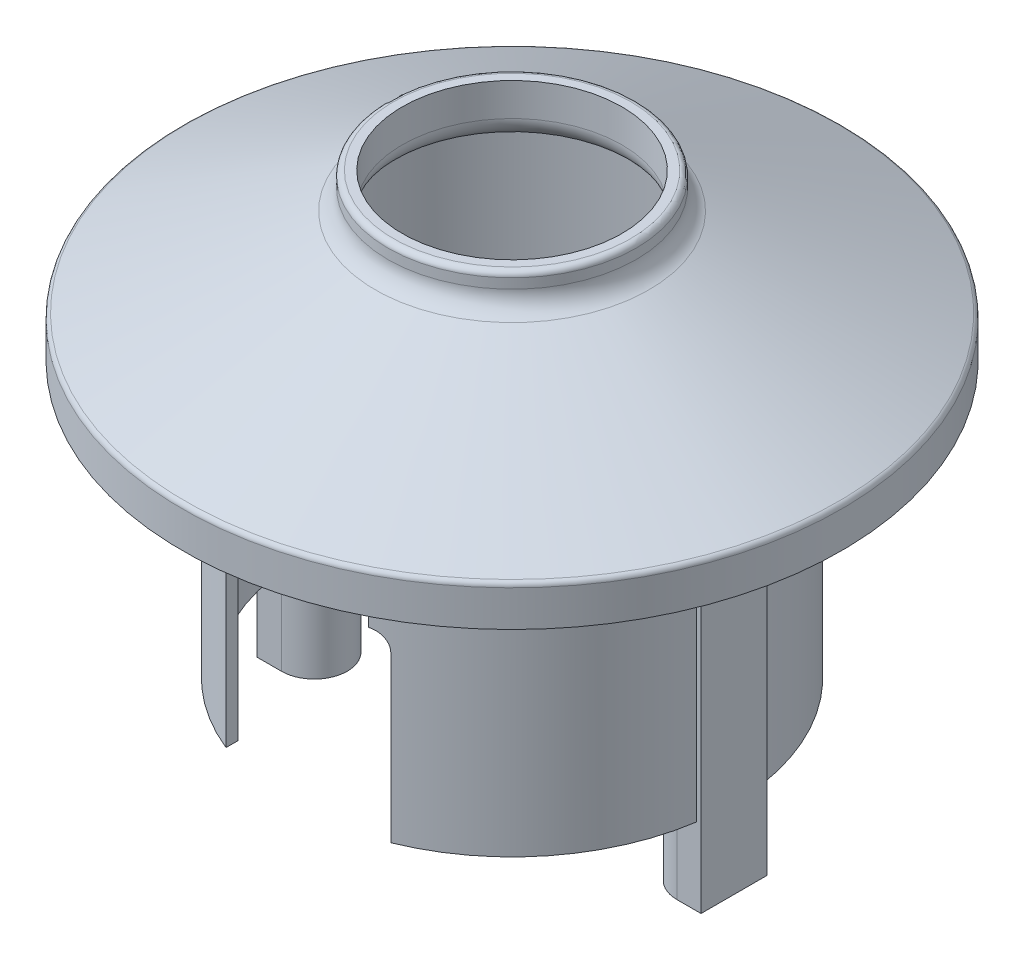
ISO-10303-21;
HEADER;
FILE_DESCRIPTION(('STEP AP214'),'2;1');
FILE_NAME('part.step','',(''),(''),'','','');
FILE_SCHEMA(('AUTOMOTIVE_DESIGN { 1 0 10303 214 1 1 1 1 }'));
ENDSEC;
DATA;
#1=APPLICATION_CONTEXT('core data for automotive mechanical design processes');
#2=APPLICATION_PROTOCOL_DEFINITION('international standard','automotive_design',2000,#1);
#3=PRODUCT_CONTEXT('',#1,'mechanical');
#4=PRODUCT('Part','Part','',(#3));
#5=PRODUCT_RELATED_PRODUCT_CATEGORY('part','',(#4));
#6=PRODUCT_DEFINITION_FORMATION('','',#4);
#7=PRODUCT_DEFINITION_CONTEXT('part definition',#1,'design');
#8=PRODUCT_DEFINITION('design','',#6,#7);
#9=PRODUCT_DEFINITION_SHAPE('','',#8);
#10=(LENGTH_UNIT() NAMED_UNIT(*) SI_UNIT(.MILLI.,.METRE.));
#11=(NAMED_UNIT(*) PLANE_ANGLE_UNIT() SI_UNIT($,.RADIAN.));
#12=(NAMED_UNIT(*) SI_UNIT($,.STERADIAN.) SOLID_ANGLE_UNIT());
#13=UNCERTAINTY_MEASURE_WITH_UNIT(LENGTH_MEASURE(1.E-05),#10,'distance_accuracy_value','');
#14=(GEOMETRIC_REPRESENTATION_CONTEXT(3) GLOBAL_UNCERTAINTY_ASSIGNED_CONTEXT((#13)) GLOBAL_UNIT_ASSIGNED_CONTEXT((#10,
#11,#12)) REPRESENTATION_CONTEXT('',''));
#15=CARTESIAN_POINT('',(0.,0.,0.));
#16=DIRECTION('',(0.,0.,1.));
#17=DIRECTION('',(1.,0.,0.));
#18=AXIS2_PLACEMENT_3D('',#15,#16,#17);
#19=CARTESIAN_POINT('',(22.86,-40.64,0.));
#20=DIRECTION('',(0.,1.,0.));
#21=DIRECTION('',(0.,0.,1.));
#22=AXIS2_PLACEMENT_3D('',#19,#20,#21);
#23=PLANE('',#22);
#24=CARTESIAN_POINT('',(22.86,-40.64,0.));
#25=DIRECTION('',(0.,-1.,0.));
#26=DIRECTION('',(0.,0.,1.));
#27=AXIS2_PLACEMENT_3D('',#24,#25,#26);
#28=CIRCLE('',#27,3.81);
#29=CARTESIAN_POINT('',(22.86,-40.64,3.81));
#30=VERTEX_POINT('',#29);
#31=CARTESIAN_POINT('',(22.86,-40.64,-3.81));
#32=VERTEX_POINT('',#31);
#33=EDGE_CURVE('E271',#30,#32,#28,.T.);
#34=ORIENTED_EDGE('',*,*,#33,.T.);
#35=DIRECTION('',(1.,0.,0.));
#36=VECTOR('',#35,1.);
#37=CARTESIAN_POINT('',(25.654,-40.64,-3.81));
#38=LINE('',#37,#36);
#39=CARTESIAN_POINT('',(25.654,-40.64,-3.81));
#40=VERTEX_POINT('',#39);
#41=EDGE_CURVE('E287',#32,#40,#38,.T.);
#42=ORIENTED_EDGE('',*,*,#41,.T.);
#43=DIRECTION('',(0.,0.,1.));
#44=VECTOR('',#43,1.);
#45=CARTESIAN_POINT('',(25.654,-40.64,3.81));
#46=LINE('',#45,#44);
#47=CARTESIAN_POINT('',(25.654,-40.64,3.81));
#48=VERTEX_POINT('',#47);
#49=EDGE_CURVE('E274',#40,#48,#46,.T.);
#50=ORIENTED_EDGE('',*,*,#49,.T.);
#51=DIRECTION('',(-1.,0.,0.));
#52=VECTOR('',#51,1.);
#53=CARTESIAN_POINT('',(22.86,-40.64,3.81));
#54=LINE('',#53,#52);
#55=EDGE_CURVE('E267',#48,#30,#54,.T.);
#56=ORIENTED_EDGE('',*,*,#55,.T.);
#57=EDGE_LOOP('',(#34,#42,#50,#56));
#58=FACE_BOUND('',#57,.T.);
#59=CARTESIAN_POINT('',(22.86,-40.64,0.));
#60=DIRECTION('',(0.,1.,0.));
#61=DIRECTION('',(0.,0.,-1.));
#62=AXIS2_PLACEMENT_3D('',#59,#60,#61);
#63=CIRCLE('',#62,1.905);
#64=CARTESIAN_POINT('',(22.86,-40.64,-1.905));
#65=VERTEX_POINT('',#64);
#66=EDGE_CURVE('E929',#65,#65,#63,.T.);
#67=ORIENTED_EDGE('',*,*,#66,.T.);
#68=EDGE_LOOP('',(#67));
#69=FACE_BOUND('',#68,.T.);
#70=ADVANCED_FACE('F34',(#58,#69),#23,.F.);
#71=CARTESIAN_POINT('',(0.,12.9379782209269,0.));
#72=DIRECTION('',(0.,-1.,0.));
#73=DIRECTION('',(0.,0.,-1.));
#74=AXIS2_PLACEMENT_3D('',#71,#72,#73);
#75=CONICAL_SURFACE('',#74,14.1665496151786,1.13446401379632);
#76=CARTESIAN_POINT('',(0.,3.13301430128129,0.));
#77=DIRECTION('',(0.,-1.,0.));
#78=DIRECTION('',(0.,0.,-1.));
#79=AXIS2_PLACEMENT_3D('',#76,#77,#78);
#80=CIRCLE('',#79,35.1933625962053);
#81=CARTESIAN_POINT('',(0.,3.13301430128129,-35.1933625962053));
#82=VERTEX_POINT('',#81);
#83=EDGE_CURVE('E830',#82,#82,#80,.T.);
#84=ORIENTED_EDGE('',*,*,#83,.T.);
#85=EDGE_LOOP('',(#84));
#86=FACE_BOUND('',#85,.T.);
#87=CARTESIAN_POINT('',(25.654,4.07237027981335,21.040726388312));
#88=CARTESIAN_POINT('',(25.654,4.20020011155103,20.6084360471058));
#89=CARTESIAN_POINT('',(25.654,4.32587205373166,20.1755088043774));
#90=CARTESIAN_POINT('',(25.654,4.57249615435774,19.3082978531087));
#91=CARTESIAN_POINT('',(25.654,4.69344816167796,18.8740141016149));
#92=CARTESIAN_POINT('',(25.654,5.0486830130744,17.568763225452));
#93=CARTESIAN_POINT('',(25.654,5.2752611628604,16.6956770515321));
#94=CARTESIAN_POINT('',(25.654,5.70499739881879,14.9398892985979));
#95=CARTESIAN_POINT('',(25.654,5.90805438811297,14.0571628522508));
#96=CARTESIAN_POINT('',(25.654,6.2853589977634,12.2856116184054));
#97=CARTESIAN_POINT('',(25.654,6.45960940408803,11.3967874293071));
#98=CARTESIAN_POINT('',(25.654,6.77051094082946,9.63733169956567));
#99=CARTESIAN_POINT('',(25.654,6.90805191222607,8.76685869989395));
#100=CARTESIAN_POINT('',(25.654,7.14747818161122,7.02096642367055));
#101=CARTESIAN_POINT('',(25.654,7.24936332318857,6.14554712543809));
#102=CARTESIAN_POINT('',(25.654,7.4137737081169,4.39275969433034));
#103=CARTESIAN_POINT('',(25.654,7.4763779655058,3.51539905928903));
#104=CARTESIAN_POINT('',(25.654,7.56013679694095,1.75869225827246));
#105=CARTESIAN_POINT('',(25.654,7.58129213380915,0.879346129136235));
#106=CARTESIAN_POINT('',(25.654,7.58129213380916,-0.879346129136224));
#107=CARTESIAN_POINT('',(25.654,7.56013679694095,-1.75869225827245));
#108=CARTESIAN_POINT('',(25.654,7.4763779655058,-3.51539905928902));
#109=CARTESIAN_POINT('',(25.654,7.4137737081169,-4.39275969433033));
#110=CARTESIAN_POINT('',(25.654,7.24936332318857,-6.14554712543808));
#111=CARTESIAN_POINT('',(25.654,7.14747818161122,-7.02096642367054));
#112=CARTESIAN_POINT('',(25.654,6.90805191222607,-8.76685869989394));
#113=CARTESIAN_POINT('',(25.654,6.77051094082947,-9.63733169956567));
#114=CARTESIAN_POINT('',(25.654,6.45960940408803,-11.3967874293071));
#115=CARTESIAN_POINT('',(25.654,6.2853589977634,-12.2856116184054));
#116=CARTESIAN_POINT('',(25.654,5.90805438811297,-14.0571628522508));
#117=CARTESIAN_POINT('',(25.654,5.70499739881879,-14.9398892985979));
#118=CARTESIAN_POINT('',(25.654,5.2752611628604,-16.6956770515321));
#119=CARTESIAN_POINT('',(25.654,5.0486830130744,-17.568763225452));
#120=CARTESIAN_POINT('',(25.654,4.69344816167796,-18.8740141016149));
#121=CARTESIAN_POINT('',(25.654,4.57249615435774,-19.3082978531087));
#122=CARTESIAN_POINT('',(25.654,4.32587205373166,-20.1755088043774));
#123=CARTESIAN_POINT('',(25.654,4.20020011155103,-20.6084360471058));
#124=CARTESIAN_POINT('',(25.654,4.07237027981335,-21.040726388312));
#125=B_SPLINE_CURVE_WITH_KNOTS('',3,(#87,#88,#89,#90,#91,#92,#93,#94,#95,#96,#97,#98,#99,#100,
#101,#102,#103,#104,#105,#106,#107,#108,#109,#110,#111,#112,#113,#114,#115,#116,#117,#118,#119,
#120,#121,#122,#123,#124),.UNSPECIFIED.,.F.,.F.,(4,2,2,2,2,2,2,2,2,2,2,2,2,2,2,2,2,2,4),(0.,
1.35237217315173,2.70478761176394,5.41049650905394,8.12743424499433,10.8441090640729,
13.4872708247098,16.1304441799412,18.7682835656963,21.4060744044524,24.0438652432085,
26.6817046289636,29.324877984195,31.9680397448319,34.6847145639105,37.4016522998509,
40.1073611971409,41.4597766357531,42.8121488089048),.UNSPECIFIED.);
#126=CARTESIAN_POINT('',(25.654,7.45008356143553,3.81));
#127=VERTEX_POINT('',#126);
#128=CARTESIAN_POINT('',(25.654,7.45008356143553,-3.81));
#129=VERTEX_POINT('',#128);
#130=EDGE_CURVE('E49',#127,#129,#125,.T.);
#131=ORIENTED_EDGE('',*,*,#130,.T.);
#132=CARTESIAN_POINT('',(48.3302528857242,-3.06273805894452,-3.81));
#133=CARTESIAN_POINT('',(46.3552125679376,-2.14464921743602,-3.81));
#134=CARTESIAN_POINT('',(44.38006763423,-1.22678511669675,-3.81));
#135=CARTESIAN_POINT('',(40.4293883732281,0.608077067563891,-3.81));
#136=CARTESIAN_POINT('',(38.4538540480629,1.52507515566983,-3.81));
#137=CARTESIAN_POINT('',(34.5022590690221,3.35776876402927,-3.81));
#138=CARTESIAN_POINT('',(32.5261984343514,4.2734643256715,-3.81));
#139=CARTESIAN_POINT('',(29.5613404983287,5.64536541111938,-3.81));
#140=CARTESIAN_POINT('',(28.5729238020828,6.10239339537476,-3.81));
#141=CARTESIAN_POINT('',(26.5957440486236,7.01569945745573,-3.81));
#142=CARTESIAN_POINT('',(25.6069809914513,7.4719775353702,-3.81));
#143=CARTESIAN_POINT('',(23.9454427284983,8.23764854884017,-3.81));
#144=CARTESIAN_POINT('',(23.2727974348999,8.5473233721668,-3.81));
#145=CARTESIAN_POINT('',(21.9272195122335,9.16604675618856,-3.81));
#146=CARTESIAN_POINT('',(21.254286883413,9.47509531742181,-3.81));
#147=CARTESIAN_POINT('',(19.908053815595,10.0923667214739,-3.81));
#148=CARTESIAN_POINT('',(19.2347533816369,10.4005895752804,-3.81));
#149=CARTESIAN_POINT('',(17.8876442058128,11.0159285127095,-3.81));
#150=CARTESIAN_POINT('',(17.2138354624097,11.3230445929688,-3.81));
#151=CARTESIAN_POINT('',(15.8654858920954,11.9357450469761,-3.81));
#152=CARTESIAN_POINT('',(15.1909450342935,12.241329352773,-3.81));
#153=CARTESIAN_POINT('',(13.8408617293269,12.8502663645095,-3.81));
#154=CARTESIAN_POINT('',(13.1653192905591,13.1536190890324,-3.81));
#155=CARTESIAN_POINT('',(12.1508424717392,13.6060841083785,-3.81));
#156=CARTESIAN_POINT('',(11.8124816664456,13.7564819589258,-3.81));
#157=CARTESIAN_POINT('',(11.1352746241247,14.0561782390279,-3.81));
#158=CARTESIAN_POINT('',(10.7964283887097,14.2054766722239,-3.81));
#159=CARTESIAN_POINT('',(10.1181113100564,14.5026767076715,-3.81));
#160=CARTESIAN_POINT('',(9.77864044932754,14.6505782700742,-3.81));
#161=CARTESIAN_POINT('',(9.09887779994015,14.9444922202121,-3.81));
#162=CARTESIAN_POINT('',(8.75858600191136,15.0905045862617,-3.81));
#163=CARTESIAN_POINT('',(8.41778465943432,15.235326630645,-3.81));
#164=B_SPLINE_CURVE_WITH_KNOTS('',3,(#132,#133,#134,#135,#136,#137,#138,#139,#140,#141,#142,
#143,#144,#145,#146,#147,#148,#149,#150,#151,#152,#153,#154,#155,#156,#157,#158,#159,#160,#161,
#162,#163),.UNSPECIFIED.,.F.,.F.,(4,2,2,2,2,2,2,2,2,2,2,2,2,2,2,4),(0.,6.5339914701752,
13.0679481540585,19.6016923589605,22.8685835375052,26.135474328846,28.3569942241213,
30.5785122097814,32.800000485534,35.0214955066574,37.2430882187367,39.4646624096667,
40.5755019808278,41.6863378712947,42.7972053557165,43.9080855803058),.UNSPECIFIED.);
#165=CARTESIAN_POINT('',(25.1126243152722,7.69973427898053,-3.81));
#166=VERTEX_POINT('',#165);
#167=EDGE_CURVE('E292',#129,#166,#164,.T.);
#168=ORIENTED_EDGE('',*,*,#167,.T.);
#169=CARTESIAN_POINT('',(0.,7.69973427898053,0.));
#170=DIRECTION('',(0.,-1.,0.));
#171=DIRECTION('',(0.,0.,-1.));
#172=AXIS2_PLACEMENT_3D('',#169,#170,#171);
#173=CIRCLE('',#172,25.4);
#174=CARTESIAN_POINT('',(-25.1126243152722,7.69973427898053,-3.81));
#175=VERTEX_POINT('',#174);
#176=EDGE_CURVE('E558',#175,#166,#173,.T.);
#177=ORIENTED_EDGE('',*,*,#176,.F.);
#178=CARTESIAN_POINT('',(-48.3302528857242,-3.06273805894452,-3.81));
#179=CARTESIAN_POINT('',(-46.3552125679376,-2.14464921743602,-3.81));
#180=CARTESIAN_POINT('',(-44.38006763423,-1.22678511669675,-3.81));
#181=CARTESIAN_POINT('',(-40.4293883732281,0.608077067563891,-3.81));
#182=CARTESIAN_POINT('',(-38.4538540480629,1.52507515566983,-3.81));
#183=CARTESIAN_POINT('',(-34.5022590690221,3.35776876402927,-3.81));
#184=CARTESIAN_POINT('',(-32.5261984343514,4.2734643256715,-3.81));
#185=CARTESIAN_POINT('',(-29.5613404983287,5.64536541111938,-3.81));
#186=CARTESIAN_POINT('',(-28.5729238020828,6.10239339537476,-3.81));
#187=CARTESIAN_POINT('',(-26.5957440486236,7.01569945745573,-3.81));
#188=CARTESIAN_POINT('',(-25.6069809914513,7.4719775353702,-3.81));
#189=CARTESIAN_POINT('',(-23.9454427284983,8.23764854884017,-3.81));
#190=CARTESIAN_POINT('',(-23.2727974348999,8.5473233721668,-3.81));
#191=CARTESIAN_POINT('',(-21.9272195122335,9.16604675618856,-3.81));
#192=CARTESIAN_POINT('',(-21.254286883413,9.47509531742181,-3.81));
#193=CARTESIAN_POINT('',(-19.908053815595,10.0923667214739,-3.81));
#194=CARTESIAN_POINT('',(-19.2347533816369,10.4005895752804,-3.81));
#195=CARTESIAN_POINT('',(-17.8876442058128,11.0159285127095,-3.81));
#196=CARTESIAN_POINT('',(-17.2138354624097,11.3230445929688,-3.81));
#197=CARTESIAN_POINT('',(-15.8654858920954,11.9357450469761,-3.81));
#198=CARTESIAN_POINT('',(-15.1909450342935,12.241329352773,-3.81));
#199=CARTESIAN_POINT('',(-13.8408617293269,12.8502663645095,-3.81));
#200=CARTESIAN_POINT('',(-13.1653192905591,13.1536190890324,-3.81));
#201=CARTESIAN_POINT('',(-12.1508424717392,13.6060841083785,-3.81));
#202=CARTESIAN_POINT('',(-11.8124816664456,13.7564819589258,-3.81));
#203=CARTESIAN_POINT('',(-11.1352746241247,14.0561782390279,-3.81));
#204=CARTESIAN_POINT('',(-10.7964283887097,14.2054766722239,-3.81));
#205=CARTESIAN_POINT('',(-10.1181113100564,14.5026767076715,-3.81));
#206=CARTESIAN_POINT('',(-9.77864044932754,14.6505782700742,-3.81));
#207=CARTESIAN_POINT('',(-9.09887779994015,14.9444922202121,-3.81));
#208=CARTESIAN_POINT('',(-8.75858600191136,15.0905045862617,-3.81));
#209=CARTESIAN_POINT('',(-8.41778465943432,15.235326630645,-3.81));
#210=B_SPLINE_CURVE_WITH_KNOTS('',3,(#178,#179,#180,#181,#182,#183,#184,#185,#186,#187,#188,
#189,#190,#191,#192,#193,#194,#195,#196,#197,#198,#199,#200,#201,#202,#203,#204,#205,#206,#207,
#208,#209),.UNSPECIFIED.,.F.,.F.,(4,2,2,2,2,2,2,2,2,2,2,2,2,2,2,4),(0.,6.5339914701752,
13.0679481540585,19.6016923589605,22.8685835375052,26.135474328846,28.3569942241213,
30.5785122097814,32.800000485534,35.0214955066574,37.2430882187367,39.4646624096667,
40.5755019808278,41.6863378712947,42.7972053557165,43.9080855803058),.UNSPECIFIED.);
#211=CARTESIAN_POINT('',(-25.654,7.45008356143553,-3.81));
#212=VERTEX_POINT('',#211);
#213=EDGE_CURVE('E337',#212,#175,#210,.T.);
#214=ORIENTED_EDGE('',*,*,#213,.F.);
#215=CARTESIAN_POINT('',(-25.654,4.07237027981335,21.040726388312));
#216=CARTESIAN_POINT('',(-25.654,4.20020011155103,20.6084360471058));
#217=CARTESIAN_POINT('',(-25.654,4.32587205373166,20.1755088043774));
#218=CARTESIAN_POINT('',(-25.654,4.57249615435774,19.3082978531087));
#219=CARTESIAN_POINT('',(-25.654,4.69344816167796,18.8740141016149));
#220=CARTESIAN_POINT('',(-25.654,5.0486830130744,17.568763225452));
#221=CARTESIAN_POINT('',(-25.654,5.2752611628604,16.6956770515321));
#222=CARTESIAN_POINT('',(-25.654,5.70499739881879,14.9398892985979));
#223=CARTESIAN_POINT('',(-25.654,5.90805438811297,14.0571628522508));
#224=CARTESIAN_POINT('',(-25.654,6.2853589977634,12.2856116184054));
#225=CARTESIAN_POINT('',(-25.654,6.45960940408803,11.3967874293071));
#226=CARTESIAN_POINT('',(-25.654,6.77051094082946,9.63733169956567));
#227=CARTESIAN_POINT('',(-25.654,6.90805191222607,8.76685869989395));
#228=CARTESIAN_POINT('',(-25.654,7.14747818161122,7.02096642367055));
#229=CARTESIAN_POINT('',(-25.654,7.24936332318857,6.14554712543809));
#230=CARTESIAN_POINT('',(-25.654,7.4137737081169,4.39275969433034));
#231=CARTESIAN_POINT('',(-25.654,7.4763779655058,3.51539905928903));
#232=CARTESIAN_POINT('',(-25.654,7.56013679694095,1.75869225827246));
#233=CARTESIAN_POINT('',(-25.654,7.58129213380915,0.879346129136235));
#234=CARTESIAN_POINT('',(-25.654,7.58129213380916,-0.879346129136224));
#235=CARTESIAN_POINT('',(-25.654,7.56013679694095,-1.75869225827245));
#236=CARTESIAN_POINT('',(-25.654,7.4763779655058,-3.51539905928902));
#237=CARTESIAN_POINT('',(-25.654,7.4137737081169,-4.39275969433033));
#238=CARTESIAN_POINT('',(-25.654,7.24936332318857,-6.14554712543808));
#239=CARTESIAN_POINT('',(-25.654,7.14747818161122,-7.02096642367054));
#240=CARTESIAN_POINT('',(-25.654,6.90805191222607,-8.76685869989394));
#241=CARTESIAN_POINT('',(-25.654,6.77051094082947,-9.63733169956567));
#242=CARTESIAN_POINT('',(-25.654,6.45960940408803,-11.3967874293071));
#243=CARTESIAN_POINT('',(-25.654,6.2853589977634,-12.2856116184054));
#244=CARTESIAN_POINT('',(-25.654,5.90805438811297,-14.0571628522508));
#245=CARTESIAN_POINT('',(-25.654,5.70499739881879,-14.9398892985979));
#246=CARTESIAN_POINT('',(-25.654,5.2752611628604,-16.6956770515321));
#247=CARTESIAN_POINT('',(-25.654,5.0486830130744,-17.568763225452));
#248=CARTESIAN_POINT('',(-25.654,4.69344816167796,-18.8740141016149));
#249=CARTESIAN_POINT('',(-25.654,4.57249615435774,-19.3082978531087));
#250=CARTESIAN_POINT('',(-25.654,4.32587205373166,-20.1755088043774));
#251=CARTESIAN_POINT('',(-25.654,4.20020011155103,-20.6084360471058));
#252=CARTESIAN_POINT('',(-25.654,4.07237027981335,-21.040726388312));
#253=B_SPLINE_CURVE_WITH_KNOTS('',3,(#215,#216,#217,#218,#219,#220,#221,#222,#223,#224,#225,
#226,#227,#228,#229,#230,#231,#232,#233,#234,#235,#236,#237,#238,#239,#240,#241,#242,#243,#244,
#245,#246,#247,#248,#249,#250,#251,#252),.UNSPECIFIED.,.F.,.F.,(4,2,2,2,2,2,2,2,2,2,2,2,2,2,2,2,
2,2,4),(0.,1.35237217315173,2.70478761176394,5.41049650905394,8.12743424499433,10.8441090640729,
13.4872708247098,16.1304441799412,18.7682835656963,21.4060744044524,24.0438652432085,
26.6817046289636,29.324877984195,31.9680397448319,34.6847145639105,37.4016522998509,
40.1073611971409,41.4597766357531,42.8121488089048),.UNSPECIFIED.);
#254=CARTESIAN_POINT('',(-25.654,7.45008356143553,3.81));
#255=VERTEX_POINT('',#254);
#256=EDGE_CURVE('E327',#255,#212,#253,.T.);
#257=ORIENTED_EDGE('',*,*,#256,.F.);
#258=CARTESIAN_POINT('',(-8.41778465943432,15.235326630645,3.81));
#259=CARTESIAN_POINT('',(-8.60370566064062,15.1563398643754,3.81));
#260=CARTESIAN_POINT('',(-8.78946905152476,15.0769833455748,3.81));
#261=CARTESIAN_POINT('',(-9.16072088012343,14.9176313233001,3.81));
#262=CARTESIAN_POINT('',(-9.34620931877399,14.8376358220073,3.81));
#263=CARTESIAN_POINT('',(-9.90231966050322,14.5968429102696,3.81));
#264=CARTESIAN_POINT('',(-10.2725914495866,14.4352370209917,3.81));
#265=CARTESIAN_POINT('',(-11.0124216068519,14.1104335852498,3.81));
#266=CARTESIAN_POINT('',(-11.381979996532,13.9472360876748,3.81));
#267=CARTESIAN_POINT('',(-12.1205561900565,13.6196193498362,3.81));
#268=CARTESIAN_POINT('',(-12.4895739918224,13.4552001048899,3.81));
#269=CARTESIAN_POINT('',(-13.5959618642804,12.9605497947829,3.81));
#270=CARTESIAN_POINT('',(-14.3327020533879,12.6289104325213,3.81));
#271=CARTESIAN_POINT('',(-15.8051117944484,11.9632510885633,3.81));
#272=CARTESIAN_POINT('',(-16.5407813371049,11.6292310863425,3.81));
#273=CARTESIAN_POINT('',(-17.8886393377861,11.0154611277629,3.81));
#274=CARTESIAN_POINT('',(-18.5009408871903,10.7359594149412,3.81));
#275=CARTESIAN_POINT('',(-19.7251557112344,10.1761122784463,3.81));
#276=CARTESIAN_POINT('',(-20.3370689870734,9.8957668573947,3.81));
#277=CARTESIAN_POINT('',(-22.1723938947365,9.05375815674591,3.81));
#278=CARTESIAN_POINT('',(-23.3953647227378,8.49113424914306,3.81));
#279=CARTESIAN_POINT('',(-26.5960825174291,7.01618172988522,3.81));
#280=CARTESIAN_POINT('',(-28.5732482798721,6.10259277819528,3.81));
#281=CARTESIAN_POINT('',(-32.5265863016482,4.2732681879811,3.81));
#282=CARTESIAN_POINT('',(-34.5027585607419,3.35753254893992,3.81));
#283=CARTESIAN_POINT('',(-38.454369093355,1.52484084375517,3.81));
#284=CARTESIAN_POINT('',(-40.4298074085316,0.607884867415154,3.81));
#285=CARTESIAN_POINT('',(-44.3802821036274,-1.22688713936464,3.81));
#286=CARTESIAN_POINT('',(-46.3553184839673,-2.14470316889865,3.81));
#287=CARTESIAN_POINT('',(-48.3302528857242,-3.06273805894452,3.81));
#288=B_SPLINE_CURVE_WITH_KNOTS('',3,(#258,#259,#260,#261,#262,#263,#264,#265,#266,#267,#268,
#269,#270,#271,#272,#273,#274,#275,#276,#277,#278,#279,#280,#281,#282,#283,#284,#285,#286,#287),
.UNSPECIFIED.,.F.,.F.,(4,2,2,2,2,2,2,2,2,2,2,2,2,2,4),(0.,0.606010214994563,1.21201836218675,
2.4240188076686,3.63598214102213,4.84795012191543,7.27176919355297,9.69560918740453,
11.7148432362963,13.7340710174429,17.7726119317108,24.3067093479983,30.8408083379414,
37.3744504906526,43.9080857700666),.UNSPECIFIED.);
#289=CARTESIAN_POINT('',(-25.1126243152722,7.69973427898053,3.81));
#290=VERTEX_POINT('',#289);
#291=EDGE_CURVE('E324',#290,#255,#288,.T.);
#292=ORIENTED_EDGE('',*,*,#291,.F.);
#293=CARTESIAN_POINT('',(25.1126243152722,7.69973427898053,3.81));
#294=VERTEX_POINT('',#293);
#295=EDGE_CURVE('E554',#294,#290,#173,.T.);
#296=ORIENTED_EDGE('',*,*,#295,.F.);
#297=CARTESIAN_POINT('',(8.41778465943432,15.235326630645,3.81));
#298=CARTESIAN_POINT('',(8.60370566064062,15.1563398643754,3.81));
#299=CARTESIAN_POINT('',(8.78946905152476,15.0769833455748,3.81));
#300=CARTESIAN_POINT('',(9.16072088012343,14.9176313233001,3.81));
#301=CARTESIAN_POINT('',(9.34620931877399,14.8376358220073,3.81));
#302=CARTESIAN_POINT('',(9.90231966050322,14.5968429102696,3.81));
#303=CARTESIAN_POINT('',(10.2725914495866,14.4352370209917,3.81));
#304=CARTESIAN_POINT('',(11.0124216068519,14.1104335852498,3.81));
#305=CARTESIAN_POINT('',(11.381979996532,13.9472360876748,3.81));
#306=CARTESIAN_POINT('',(12.1205561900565,13.6196193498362,3.81));
#307=CARTESIAN_POINT('',(12.4895739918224,13.4552001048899,3.81));
#308=CARTESIAN_POINT('',(13.5959618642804,12.9605497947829,3.81));
#309=CARTESIAN_POINT('',(14.3327020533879,12.6289104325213,3.81));
#310=CARTESIAN_POINT('',(15.8051117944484,11.9632510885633,3.81));
#311=CARTESIAN_POINT('',(16.5407813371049,11.6292310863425,3.81));
#312=CARTESIAN_POINT('',(17.8886393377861,11.0154611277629,3.81));
#313=CARTESIAN_POINT('',(18.5009408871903,10.7359594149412,3.81));
#314=CARTESIAN_POINT('',(19.7251557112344,10.1761122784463,3.81));
#315=CARTESIAN_POINT('',(20.3370689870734,9.8957668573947,3.81));
#316=CARTESIAN_POINT('',(22.1723938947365,9.05375815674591,3.81));
#317=CARTESIAN_POINT('',(23.3953647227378,8.49113424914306,3.81));
#318=CARTESIAN_POINT('',(26.5960825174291,7.01618172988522,3.81));
#319=CARTESIAN_POINT('',(28.5732482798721,6.10259277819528,3.81));
#320=CARTESIAN_POINT('',(32.5265863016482,4.2732681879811,3.81));
#321=CARTESIAN_POINT('',(34.5027585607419,3.35753254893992,3.81));
#322=CARTESIAN_POINT('',(38.454369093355,1.52484084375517,3.81));
#323=CARTESIAN_POINT('',(40.4298074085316,0.607884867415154,3.81));
#324=CARTESIAN_POINT('',(44.3802821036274,-1.22688713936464,3.81));
#325=CARTESIAN_POINT('',(46.3553184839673,-2.14470316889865,3.81));
#326=CARTESIAN_POINT('',(48.3302528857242,-3.06273805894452,3.81));
#327=B_SPLINE_CURVE_WITH_KNOTS('',3,(#297,#298,#299,#300,#301,#302,#303,#304,#305,#306,#307,
#308,#309,#310,#311,#312,#313,#314,#315,#316,#317,#318,#319,#320,#321,#322,#323,#324,#325,#326),
.UNSPECIFIED.,.F.,.F.,(4,2,2,2,2,2,2,2,2,2,2,2,2,2,4),(0.,0.606010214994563,1.21201836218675,
2.4240188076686,3.63598214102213,4.84795012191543,7.27176919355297,9.69560918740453,
11.7148432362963,13.7340710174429,17.7726119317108,24.3067093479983,30.8408083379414,
37.3744504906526,43.9080857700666),.UNSPECIFIED.);
#328=EDGE_CURVE('E54',#294,#127,#327,.T.);
#329=ORIENTED_EDGE('',*,*,#328,.T.);
#330=EDGE_LOOP('',(#131,#168,#177,#214,#257,#292,#296,#329));
#331=FACE_BOUND('',#330,.T.);
#332=ADVANCED_FACE('F716',(#86,#331),#75,.F.);
#333=CARTESIAN_POINT('',(0.,12.9379782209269,0.));
#334=DIRECTION('',(0.,-1.,0.));
#335=DIRECTION('',(0.,0.,-1.));
#336=AXIS2_PLACEMENT_3D('',#333,#334,#335);
#337=CIRCLE('',#336,14.1665496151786);
#338=CARTESIAN_POINT('',(0.,12.9379782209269,-14.1665496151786));
#339=VERTEX_POINT('',#338);
#340=EDGE_CURVE('E827',#339,#339,#337,.T.);
#341=ORIENTED_EDGE('',*,*,#340,.F.);
#342=EDGE_LOOP('',(#341));
#343=FACE_BOUND('',#342,.T.);
#344=CARTESIAN_POINT('',(0.,8.29194500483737,0.));
#345=DIRECTION('',(0.,-1.,0.));
#346=DIRECTION('',(0.,0.,-1.));
#347=AXIS2_PLACEMENT_3D('',#344,#345,#346);
#348=CIRCLE('',#347,24.13);
#349=CARTESIAN_POINT('',(23.827312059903,8.29194500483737,-3.81));
#350=VERTEX_POINT('',#349);
#351=CARTESIAN_POINT('',(-23.827312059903,8.29194500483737,-3.81));
#352=VERTEX_POINT('',#351);
#353=EDGE_CURVE('E795',#350,#352,#348,.F.);
#354=ORIENTED_EDGE('',*,*,#353,.F.);
#355=CARTESIAN_POINT('',(22.86,8.73711715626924,-3.81));
#356=VERTEX_POINT('',#355);
#357=EDGE_CURVE('E294',#350,#356,#164,.T.);
#358=ORIENTED_EDGE('',*,*,#357,.T.);
#359=CARTESIAN_POINT('',(22.8602,8.73702516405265,-3.80999999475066));
#360=CARTESIAN_POINT('',(22.7425294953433,8.79114654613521,-3.81000168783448));
#361=CARTESIAN_POINT('',(22.6250698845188,8.84558246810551,-3.80455967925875));
#362=CARTESIAN_POINT('',(22.3912923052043,8.95475939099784,-3.78288348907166));
#363=CARTESIAN_POINT('',(22.2749743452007,9.00950039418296,-3.76664922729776));
#364=CARTESIAN_POINT('',(21.9286458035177,9.17377422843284,-3.70186931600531));
#365=CARTESIAN_POINT('',(21.7014355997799,9.2832773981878,-3.63724680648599));
#366=CARTESIAN_POINT('',(21.2611687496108,9.49882746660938,-3.46635574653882));
#367=CARTESIAN_POINT('',(21.0481224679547,9.60487180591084,-3.36005708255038));
#368=CARTESIAN_POINT('',(20.7444864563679,9.7583006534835,-3.17095599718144));
#369=CARTESIAN_POINT('',(20.6458962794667,9.80852164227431,-3.1029492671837));
#370=CARTESIAN_POINT('',(20.4548429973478,9.90656494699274,-2.95731726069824));
#371=CARTESIAN_POINT('',(20.3623769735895,9.95438840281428,-2.87969661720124));
#372=CARTESIAN_POINT('',(20.1876747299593,10.045384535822,-2.71816488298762));
#373=CARTESIAN_POINT('',(20.1051896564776,10.0886628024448,-2.63458223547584));
#374=CARTESIAN_POINT('',(19.9476100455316,10.1718703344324,-2.45926118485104));
#375=CARTESIAN_POINT('',(19.8725114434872,10.2118014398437,-2.36752732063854));
#376=CARTESIAN_POINT('',(19.7305416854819,10.2877300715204,-2.17640940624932));
#377=CARTESIAN_POINT('',(19.6636685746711,10.3237285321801,-2.07702718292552));
#378=CARTESIAN_POINT('',(19.5390143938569,10.3911778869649,-1.87126089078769));
#379=CARTESIAN_POINT('',(19.4812319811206,10.4226294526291,-1.76487785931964));
#380=CARTESIAN_POINT('',(19.3814034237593,10.47720452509,-1.55794131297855));
#381=CARTESIAN_POINT('',(19.3383269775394,10.5008628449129,-1.45802505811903));
#382=CARTESIAN_POINT('',(19.2606359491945,10.5436687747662,-1.25402785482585));
#383=CARTESIAN_POINT('',(19.2260200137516,10.5628171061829,-1.14994757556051));
#384=CARTESIAN_POINT('',(19.1657744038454,10.5962230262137,-0.938545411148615));
#385=CARTESIAN_POINT('',(19.1401372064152,10.6104847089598,-0.831226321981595));
#386=CARTESIAN_POINT('',(19.0982141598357,10.6338418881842,-0.614226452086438));
#387=CARTESIAN_POINT('',(19.0819272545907,10.642937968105,-0.504545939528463));
#388=CARTESIAN_POINT('',(19.0603390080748,10.6550026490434,-0.297030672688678));
#389=CARTESIAN_POINT('',(19.053960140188,10.6585721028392,-0.199341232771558));
#390=CARTESIAN_POINT('',(19.0487445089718,10.6614903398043,-0.00366502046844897));
#391=CARTESIAN_POINT('',(19.0499100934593,10.6608378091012,0.0943218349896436));
#392=CARTESIAN_POINT('',(19.0597748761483,10.6553194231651,0.289742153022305));
#393=CARTESIAN_POINT('',(19.0684696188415,10.6504560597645,0.387175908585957));
#394=CARTESIAN_POINT('',(19.0932633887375,10.6366093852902,0.580811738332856));
#395=CARTESIAN_POINT('',(19.1093651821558,10.6276245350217,0.677013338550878));
#396=CARTESIAN_POINT('',(19.1668788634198,10.5955995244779,0.954781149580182));
#397=CARTESIAN_POINT('',(19.2179655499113,10.5672228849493,1.13384579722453));
#398=CARTESIAN_POINT('',(19.3444780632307,10.4974412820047,1.48030542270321));
#399=CARTESIAN_POINT('',(19.4199083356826,10.4560339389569,1.6476982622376));
#400=CARTESIAN_POINT('',(19.5973019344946,10.3595057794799,1.97681781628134));
#401=CARTESIAN_POINT('',(19.7005432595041,10.3037324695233,2.1376628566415));
#402=CARTESIAN_POINT('',(19.9276142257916,10.1823774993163,2.43987521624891));
#403=CARTESIAN_POINT('',(20.0514508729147,10.1167925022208,2.58123587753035));
#404=CARTESIAN_POINT('',(20.3310782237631,9.97042853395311,2.85716757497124));
#405=CARTESIAN_POINT('',(20.4888925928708,9.88877075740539,2.98922098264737));
#406=CARTESIAN_POINT('',(20.8213634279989,9.71909547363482,3.22516218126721));
#407=CARTESIAN_POINT('',(20.9960336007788,9.63107280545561,3.32902678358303));
#408=CARTESIAN_POINT('',(21.3776618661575,9.44142939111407,3.51693023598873));
#409=CARTESIAN_POINT('',(21.5860661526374,9.33937024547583,3.59758937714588));
#410=CARTESIAN_POINT('',(22.0127624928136,9.13359953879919,3.72122420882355));
#411=CARTESIAN_POINT('',(22.2310416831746,9.02989023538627,3.76424751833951));
#412=CARTESIAN_POINT('',(22.5192335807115,8.89496254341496,3.79534668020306));
#413=CARTESIAN_POINT('',(22.5873150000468,8.86323147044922,3.80084460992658));
#414=CARTESIAN_POINT('',(22.7236389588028,8.7999750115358,3.80816855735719));
#415=CARTESIAN_POINT('',(22.7918810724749,8.76844937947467,3.81000037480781));
#416=CARTESIAN_POINT('',(22.8602,8.73702516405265,3.80999999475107));
#417=B_SPLINE_CURVE_WITH_KNOTS('',3,(#359,#360,#361,#362,#363,#364,#365,#366,#367,#368,#369,
#370,#371,#372,#373,#374,#375,#376,#377,#378,#379,#380,#381,#382,#383,#384,#385,#386,#387,#388,
#389,#390,#391,#392,#393,#394,#395,#396,#397,#398,#399,#400,#401,#402,#403,#404,#405,#406,#407,
#408,#409,#410,#411,#412,#413,#414,#415,#416),.UNSPECIFIED.,.F.,.F.,(4,2,2,2,2,2,2,2,2,2,2,2,2,
2,2,2,2,2,2,2,2,2,2,2,2,2,2,2,4),(0.,0.388327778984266,0.776658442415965,1.55389042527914,
2.33168504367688,2.72087230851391,3.10987274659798,3.48482366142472,3.85956708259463,
4.23422127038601,4.60882006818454,4.94239959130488,5.27592572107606,5.60917172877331,
5.94238008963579,6.23589524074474,6.52950173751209,6.82293460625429,7.11647714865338,
7.67883040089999,8.24128640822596,8.83613844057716,9.43119323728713,10.0926456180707,
10.7546404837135,11.4885538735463,12.2215373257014,12.4474161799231,12.6729374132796),.UNSPECIFIED.);
#418=CARTESIAN_POINT('',(22.86,8.73711715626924,3.81));
#419=VERTEX_POINT('',#418);
#420=EDGE_CURVE('E897',#356,#419,#417,.T.);
#421=ORIENTED_EDGE('',*,*,#420,.T.);
#422=CARTESIAN_POINT('',(23.827312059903,8.29194500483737,3.81));
#423=VERTEX_POINT('',#422);
#424=EDGE_CURVE('E283',#419,#423,#327,.T.);
#425=ORIENTED_EDGE('',*,*,#424,.T.);
#426=CARTESIAN_POINT('',(-23.827312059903,8.29194500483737,3.81));
#427=VERTEX_POINT('',#426);
#428=EDGE_CURVE('E791',#427,#423,#348,.F.);
#429=ORIENTED_EDGE('',*,*,#428,.F.);
#430=CARTESIAN_POINT('',(-22.86,8.73711715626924,3.81));
#431=VERTEX_POINT('',#430);
#432=EDGE_CURVE('E336',#431,#427,#288,.T.);
#433=ORIENTED_EDGE('',*,*,#432,.F.);
#434=CARTESIAN_POINT('',(-22.8602,8.73702516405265,-3.80999999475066));
#435=CARTESIAN_POINT('',(-22.7425294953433,8.79114654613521,-3.81000168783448));
#436=CARTESIAN_POINT('',(-22.6250698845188,8.84558246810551,-3.80455967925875));
#437=CARTESIAN_POINT('',(-22.3912923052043,8.95475939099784,-3.78288348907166));
#438=CARTESIAN_POINT('',(-22.2749743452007,9.00950039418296,-3.76664922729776));
#439=CARTESIAN_POINT('',(-21.9286458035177,9.17377422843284,-3.70186931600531));
#440=CARTESIAN_POINT('',(-21.7014355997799,9.2832773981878,-3.63724680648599));
#441=CARTESIAN_POINT('',(-21.2611687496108,9.49882746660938,-3.46635574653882));
#442=CARTESIAN_POINT('',(-21.0481224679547,9.60487180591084,-3.36005708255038));
#443=CARTESIAN_POINT('',(-20.7444864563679,9.7583006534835,-3.17095599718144));
#444=CARTESIAN_POINT('',(-20.6458962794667,9.80852164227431,-3.1029492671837));
#445=CARTESIAN_POINT('',(-20.4548429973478,9.90656494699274,-2.95731726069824));
#446=CARTESIAN_POINT('',(-20.3623769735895,9.95438840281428,-2.87969661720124));
#447=CARTESIAN_POINT('',(-20.1876747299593,10.045384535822,-2.71816488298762));
#448=CARTESIAN_POINT('',(-20.1051896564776,10.0886628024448,-2.63458223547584));
#449=CARTESIAN_POINT('',(-19.9476100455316,10.1718703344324,-2.45926118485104));
#450=CARTESIAN_POINT('',(-19.8725114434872,10.2118014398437,-2.36752732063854));
#451=CARTESIAN_POINT('',(-19.7305416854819,10.2877300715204,-2.17640940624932));
#452=CARTESIAN_POINT('',(-19.6636685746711,10.3237285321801,-2.07702718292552));
#453=CARTESIAN_POINT('',(-19.5390143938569,10.3911778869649,-1.87126089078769));
#454=CARTESIAN_POINT('',(-19.4812319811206,10.4226294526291,-1.76487785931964));
#455=CARTESIAN_POINT('',(-19.3814034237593,10.47720452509,-1.55794131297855));
#456=CARTESIAN_POINT('',(-19.3383269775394,10.5008628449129,-1.45802505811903));
#457=CARTESIAN_POINT('',(-19.2606359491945,10.5436687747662,-1.25402785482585));
#458=CARTESIAN_POINT('',(-19.2260200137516,10.5628171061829,-1.14994757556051));
#459=CARTESIAN_POINT('',(-19.1657744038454,10.5962230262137,-0.938545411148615));
#460=CARTESIAN_POINT('',(-19.1401372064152,10.6104847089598,-0.831226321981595));
#461=CARTESIAN_POINT('',(-19.0982141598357,10.6338418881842,-0.614226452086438));
#462=CARTESIAN_POINT('',(-19.0819272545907,10.642937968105,-0.504545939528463));
#463=CARTESIAN_POINT('',(-19.0603390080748,10.6550026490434,-0.297030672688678));
#464=CARTESIAN_POINT('',(-19.053960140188,10.6585721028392,-0.199341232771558));
#465=CARTESIAN_POINT('',(-19.0487445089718,10.6614903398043,-0.00366502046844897));
#466=CARTESIAN_POINT('',(-19.0499100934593,10.6608378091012,0.0943218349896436));
#467=CARTESIAN_POINT('',(-19.0597748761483,10.6553194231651,0.289742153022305));
#468=CARTESIAN_POINT('',(-19.0684696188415,10.6504560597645,0.387175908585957));
#469=CARTESIAN_POINT('',(-19.0932633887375,10.6366093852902,0.580811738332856));
#470=CARTESIAN_POINT('',(-19.1093651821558,10.6276245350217,0.677013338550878));
#471=CARTESIAN_POINT('',(-19.1668788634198,10.5955995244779,0.954781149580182));
#472=CARTESIAN_POINT('',(-19.2179655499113,10.5672228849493,1.13384579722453));
#473=CARTESIAN_POINT('',(-19.3444780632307,10.4974412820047,1.48030542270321));
#474=CARTESIAN_POINT('',(-19.4199083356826,10.4560339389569,1.6476982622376));
#475=CARTESIAN_POINT('',(-19.5973019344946,10.3595057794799,1.97681781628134));
#476=CARTESIAN_POINT('',(-19.7005432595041,10.3037324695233,2.1376628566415));
#477=CARTESIAN_POINT('',(-19.9276142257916,10.1823774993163,2.43987521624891));
#478=CARTESIAN_POINT('',(-20.0514508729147,10.1167925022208,2.58123587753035));
#479=CARTESIAN_POINT('',(-20.3310782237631,9.97042853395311,2.85716757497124));
#480=CARTESIAN_POINT('',(-20.4888925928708,9.88877075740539,2.98922098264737));
#481=CARTESIAN_POINT('',(-20.8213634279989,9.71909547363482,3.22516218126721));
#482=CARTESIAN_POINT('',(-20.9960336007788,9.63107280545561,3.32902678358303));
#483=CARTESIAN_POINT('',(-21.3776618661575,9.44142939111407,3.51693023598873));
#484=CARTESIAN_POINT('',(-21.5860661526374,9.33937024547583,3.59758937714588));
#485=CARTESIAN_POINT('',(-22.0127624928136,9.13359953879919,3.72122420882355));
#486=CARTESIAN_POINT('',(-22.2310416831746,9.02989023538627,3.76424751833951));
#487=CARTESIAN_POINT('',(-22.5192335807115,8.89496254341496,3.79534668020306));
#488=CARTESIAN_POINT('',(-22.5873150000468,8.86323147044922,3.80084460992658));
#489=CARTESIAN_POINT('',(-22.7236389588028,8.7999750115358,3.80816855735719));
#490=CARTESIAN_POINT('',(-22.7918810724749,8.76844937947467,3.81000037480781));
#491=CARTESIAN_POINT('',(-22.8602,8.73702516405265,3.80999999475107));
#492=B_SPLINE_CURVE_WITH_KNOTS('',3,(#434,#435,#436,#437,#438,#439,#440,#441,#442,#443,#444,
#445,#446,#447,#448,#449,#450,#451,#452,#453,#454,#455,#456,#457,#458,#459,#460,#461,#462,#463,
#464,#465,#466,#467,#468,#469,#470,#471,#472,#473,#474,#475,#476,#477,#478,#479,#480,#481,#482,
#483,#484,#485,#486,#487,#488,#489,#490,#491),.UNSPECIFIED.,.F.,.F.,(4,2,2,2,2,2,2,2,2,2,2,2,2,
2,2,2,2,2,2,2,2,2,2,2,2,2,2,2,4),(0.,0.388327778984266,0.776658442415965,1.55389042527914,
2.33168504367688,2.72087230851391,3.10987274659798,3.48482366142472,3.85956708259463,
4.23422127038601,4.60882006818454,4.94239959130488,5.27592572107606,5.60917172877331,
5.94238008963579,6.23589524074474,6.52950173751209,6.82293460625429,7.11647714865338,
7.67883040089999,8.24128640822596,8.83613844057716,9.43119323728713,10.0926456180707,
10.7546404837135,11.4885538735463,12.2215373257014,12.4474161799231,12.6729374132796),.UNSPECIFIED.);
#493=CARTESIAN_POINT('',(-22.86,8.73711715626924,-3.81));
#494=VERTEX_POINT('',#493);
#495=EDGE_CURVE('E358',#494,#431,#492,.T.);
#496=ORIENTED_EDGE('',*,*,#495,.F.);
#497=EDGE_CURVE('E335',#352,#494,#210,.T.);
#498=ORIENTED_EDGE('',*,*,#497,.F.);
#499=EDGE_LOOP('',(#354,#358,#421,#425,#429,#433,#496,#498));
#500=FACE_BOUND('',#499,.T.);
#501=ADVANCED_FACE('F444',(#343,#500),#75,.F.);
#502=CARTESIAN_POINT('',(0.,19.5439487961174,0.));
#503=DIRECTION('',(0.,-1.,0.));
#504=DIRECTION('',(0.,0.,-1.));
#505=AXIS2_PLACEMENT_3D('',#502,#503,#504);
#506=CYLINDRICAL_SURFACE('',#505,25.4);
#507=DIRECTION('',(0.,-1.,0.));
#508=VECTOR('',#507,1.);
#509=CARTESIAN_POINT('',(25.1126243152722,19.5439487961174,-3.81));
#510=LINE('',#509,#508);
#511=CARTESIAN_POINT('',(25.1126243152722,-31.75,-3.81));
#512=VERTEX_POINT('',#511);
#513=EDGE_CURVE('E317',#512,#166,#510,.F.);
#514=ORIENTED_EDGE('',*,*,#513,.F.);
#515=CARTESIAN_POINT('',(0.,-31.75,0.));
#516=DIRECTION('',(0.,1.,0.));
#517=DIRECTION('',(0.,0.,1.));
#518=AXIS2_PLACEMENT_3D('',#515,#516,#517);
#519=CIRCLE('',#518,25.4);
#520=CARTESIAN_POINT('',(9.52500000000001,-31.75,-23.5464301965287));
#521=VERTEX_POINT('',#520);
#522=EDGE_CURVE('E555',#512,#521,#519,.T.);
#523=ORIENTED_EDGE('',*,*,#522,.T.);
#524=DIRECTION('',(0.,-1.,0.));
#525=VECTOR('',#524,1.);
#526=CARTESIAN_POINT('',(9.525,19.5439487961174,-23.5464301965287));
#527=LINE('',#526,#525);
#528=CARTESIAN_POINT('',(9.52500000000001,-12.7,-23.5464301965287));
#529=VERTEX_POINT('',#528);
#530=EDGE_CURVE('E625',#521,#529,#527,.F.);
#531=ORIENTED_EDGE('',*,*,#530,.T.);
#532=CARTESIAN_POINT('',(9.52500000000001,-12.7,-23.5464301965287));
#533=CARTESIAN_POINT('',(9.52500707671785,-12.6490673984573,-23.5464260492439));
#534=CARTESIAN_POINT('',(9.52295752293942,-12.5981387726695,-23.5472563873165));
#535=CARTESIAN_POINT('',(9.51479966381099,-12.4966721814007,-23.5505546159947));
#536=CARTESIAN_POINT('',(9.50869227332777,-12.4461341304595,-23.5530221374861));
#537=CARTESIAN_POINT('',(9.49249695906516,-12.3459550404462,-23.5595537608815));
#538=CARTESIAN_POINT('',(9.48242074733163,-12.2963118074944,-23.5636131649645));
#539=CARTESIAN_POINT('',(9.4584000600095,-12.1981356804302,-23.5732652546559));
#540=CARTESIAN_POINT('',(9.4444554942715,-12.1496028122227,-23.5788579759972));
#541=CARTESIAN_POINT('',(9.39701706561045,-12.0062108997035,-23.5978228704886));
#542=CARTESIAN_POINT('',(9.35789724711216,-11.9134291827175,-23.6133904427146));
#543=CARTESIAN_POINT('',(9.2660987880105,-11.7359506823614,-23.6495630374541));
#544=CARTESIAN_POINT('',(9.21341366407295,-11.6512577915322,-23.6701704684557));
#545=CARTESIAN_POINT('',(9.0941592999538,-11.4890725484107,-23.7162492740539));
#546=CARTESIAN_POINT('',(9.0271791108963,-11.4119226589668,-23.7418621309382));
#547=CARTESIAN_POINT('',(8.88249039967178,-11.269812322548,-23.7963723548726));
#548=CARTESIAN_POINT('',(8.80477836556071,-11.2048558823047,-23.8252707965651));
#549=CARTESIAN_POINT('',(8.63514221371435,-11.0844376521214,-23.8872978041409));
#550=CARTESIAN_POINT('',(8.54261439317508,-11.0299052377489,-23.9205800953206));
#551=CARTESIAN_POINT('',(8.35013169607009,-10.9372343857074,-23.9884496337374));
#552=CARTESIAN_POINT('',(8.25017688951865,-10.8990957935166,-24.0230368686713));
#553=CARTESIAN_POINT('',(8.06218037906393,-10.8448879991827,-24.0867056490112));
#554=CARTESIAN_POINT('',(7.97486676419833,-10.826228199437,-24.1157616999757));
#555=CARTESIAN_POINT('',(7.79843341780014,-10.801280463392,-24.1733985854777));
#556=CARTESIAN_POINT('',(7.70931551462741,-10.794980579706,-24.2019798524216));
#557=CARTESIAN_POINT('',(7.62,-10.795,-24.2300557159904));
#558=B_SPLINE_CURVE_WITH_KNOTS('',3,(#532,#533,#534,#535,#536,#537,#538,#539,#540,#541,#542,
#543,#544,#545,#546,#547,#548,#549,#550,#551,#552,#553,#554,#555,#556,#557),.UNSPECIFIED.,.F.,
.F.,(4,2,2,2,2,2,2,2,2,2,2,2,4),(0.,0.152743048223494,0.305451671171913,0.457712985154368,
0.609977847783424,0.914118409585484,1.21840460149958,1.5330304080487,1.84775941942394,
2.18360370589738,2.5194448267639,2.80031350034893,3.08091054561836),.UNSPECIFIED.);
#559=CARTESIAN_POINT('',(7.62,-10.795,-24.2300557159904));
#560=VERTEX_POINT('',#559);
#561=EDGE_CURVE('E454',#529,#560,#558,.T.);
#562=ORIENTED_EDGE('',*,*,#561,.T.);
#563=DIRECTION('',(0.,-1.,0.));
#564=VECTOR('',#563,1.);
#565=CARTESIAN_POINT('',(7.62,19.5439487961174,-24.2300557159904));
#566=LINE('',#565,#564);
#567=CARTESIAN_POINT('',(7.62,-1.90500000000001,-24.2300557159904));
#568=VERTEX_POINT('',#567);
#569=EDGE_CURVE('E635',#560,#568,#566,.F.);
#570=ORIENTED_EDGE('',*,*,#569,.T.);
#571=CARTESIAN_POINT('',(7.62,-1.90500000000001,-24.2300557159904));
#572=CARTESIAN_POINT('',(7.62000094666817,-1.85305675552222,-24.2300544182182));
#573=CARTESIAN_POINT('',(7.61787409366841,-1.80113921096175,-24.2307243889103));
#574=CARTESIAN_POINT('',(7.60939786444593,-1.69769254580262,-24.2333879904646));
#575=CARTESIAN_POINT('',(7.60304917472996,-1.64616336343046,-24.2353814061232));
#576=CARTESIAN_POINT('',(7.57777079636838,-1.49295285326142,-24.243302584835));
#577=CARTESIAN_POINT('',(7.55260832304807,-1.39232535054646,-24.2511715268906));
#578=CARTESIAN_POINT('',(7.48654462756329,-1.19697199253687,-24.2716465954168));
#579=CARTESIAN_POINT('',(7.44564452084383,-1.10224571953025,-24.2842523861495));
#580=CARTESIAN_POINT('',(7.34945111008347,-0.921072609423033,-24.3135371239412));
#581=CARTESIAN_POINT('',(7.29415407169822,-0.834627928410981,-24.3302171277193));
#582=CARTESIAN_POINT('',(7.16946124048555,-0.670315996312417,-24.3672554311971));
#583=CARTESIAN_POINT('',(7.09977667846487,-0.59268500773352,-24.3876879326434));
#584=CARTESIAN_POINT('',(6.94911549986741,-0.450095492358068,-24.431044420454));
#585=CARTESIAN_POINT('',(6.86813548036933,-0.385140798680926,-24.4539691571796));
#586=CARTESIAN_POINT('',(6.6935000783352,-0.266972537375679,-24.5023588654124));
#587=CARTESIAN_POINT('',(6.59945870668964,-0.214356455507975,-24.5278897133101));
#588=CARTESIAN_POINT('',(6.40403888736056,-0.125743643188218,-24.5796356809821));
#589=CARTESIAN_POINT('',(6.30266251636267,-0.0897422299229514,-24.605850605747));
#590=CARTESIAN_POINT('',(6.12014257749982,-0.0417942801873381,-24.6517840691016));
#591=CARTESIAN_POINT('',(6.03996205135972,-0.0261531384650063,-24.6715561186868));
#592=CARTESIAN_POINT('',(5.87823117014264,-0.00525355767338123,-24.7105931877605));
#593=CARTESIAN_POINT('',(5.7966823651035,1.59227603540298E-05,-24.7298587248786));
#594=CARTESIAN_POINT('',(5.71499999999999,0.,-24.7487125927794));
#595=B_SPLINE_CURVE_WITH_KNOTS('',3,(#571,#572,#573,#574,#575,#576,#577,#578,#579,#580,#581,
#582,#583,#584,#585,#586,#587,#588,#589,#590,#591,#592,#593,#594),.UNSPECIFIED.,.F.,.F.,(4,2,2,
2,2,2,2,2,2,2,2,4),(0.,0.155731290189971,0.31143726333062,0.621892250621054,0.932325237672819,
1.24283882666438,1.5603267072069,1.87791044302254,2.20864350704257,2.53928329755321,
2.79080700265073,3.04206279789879),.UNSPECIFIED.);
#596=CARTESIAN_POINT('',(5.71499999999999,0.,-24.7487125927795));
#597=VERTEX_POINT('',#596);
#598=EDGE_CURVE('E470',#568,#597,#595,.T.);
#599=ORIENTED_EDGE('',*,*,#598,.T.);
#600=CARTESIAN_POINT('',(0.,0.,0.));
#601=DIRECTION('',(0.,1.,0.));
#602=DIRECTION('',(0.,0.,1.));
#603=AXIS2_PLACEMENT_3D('',#600,#601,#602);
#604=CIRCLE('',#603,25.4);
#605=CARTESIAN_POINT('',(-5.71499999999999,0.,-24.7487125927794));
#606=VERTEX_POINT('',#605);
#607=EDGE_CURVE('E643',#597,#606,#604,.T.);
#608=ORIENTED_EDGE('',*,*,#607,.T.);
#609=CARTESIAN_POINT('',(-5.71499999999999,0.,-24.7487125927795));
#610=CARTESIAN_POINT('',(-5.77017763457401,-1.06992004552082E-06,-24.7359719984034));
#611=CARTESIAN_POINT('',(-5.82528428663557,-0.00239859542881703,-24.7230510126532));
#612=CARTESIAN_POINT('',(-5.93501512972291,-0.0119456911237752,-24.6969384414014));
#613=CARTESIAN_POINT('',(-5.98963935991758,-0.019094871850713,-24.6837468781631));
#614=CARTESIAN_POINT('',(-6.15215297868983,-0.0475849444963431,-24.6439322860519));
#615=CARTESIAN_POINT('',(-6.25882581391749,-0.0759685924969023,-24.617036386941));
#616=CARTESIAN_POINT('',(-6.46572713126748,-0.150704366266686,-24.5635060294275));
#617=CARTESIAN_POINT('',(-6.56595351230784,-0.197062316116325,-24.5368716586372));
#618=CARTESIAN_POINT('',(-6.75716556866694,-0.306549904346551,-24.4849040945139));
#619=CARTESIAN_POINT('',(-6.84815275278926,-0.369676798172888,-24.4595706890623));
#620=CARTESIAN_POINT('',(-7.01789339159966,-0.510855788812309,-24.4114101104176));
#621=CARTESIAN_POINT('',(-7.09669002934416,-0.588852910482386,-24.3885741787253));
#622=CARTESIAN_POINT('',(-7.23995957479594,-0.757919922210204,-24.3464284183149));
#623=CARTESIAN_POINT('',(-7.3044316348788,-0.848990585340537,-24.3271187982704));
#624=CARTESIAN_POINT('',(-7.41504913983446,-1.03865994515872,-24.2936266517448));
#625=CARTESIAN_POINT('',(-7.46169712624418,-1.13694107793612,-24.2793047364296));
#626=CARTESIAN_POINT('',(-7.53767362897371,-1.34050780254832,-24.2558256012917));
#627=CARTESIAN_POINT('',(-7.56702345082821,-1.44578459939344,-24.2466620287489));
#628=CARTESIAN_POINT('',(-7.59808388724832,-1.6108612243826,-24.2369396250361));
#629=CARTESIAN_POINT('',(-7.60629689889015,-1.6693942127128,-24.2343619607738));
#630=CARTESIAN_POINT('',(-7.617253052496,-1.78694101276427,-24.230919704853));
#631=CARTESIAN_POINT('',(-7.62000344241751,-1.84595408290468,-24.230052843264));
#632=CARTESIAN_POINT('',(-7.62,-1.90500000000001,-24.2300557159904));
#633=B_SPLINE_CURVE_WITH_KNOTS('',3,(#609,#610,#611,#612,#613,#614,#615,#616,#617,#618,#619,
#620,#621,#622,#623,#624,#625,#626,#627,#628,#629,#630,#631,#632),.UNSPECIFIED.,.F.,.F.,(4,2,2,
2,2,2,2,2,2,2,2,4),(0.,0.169781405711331,0.339548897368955,0.678650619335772,1.01786230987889,
1.35701851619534,1.69494436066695,2.03289019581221,2.36044512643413,2.68759577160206,
2.86483435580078,3.04183761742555),.UNSPECIFIED.);
#634=CARTESIAN_POINT('',(-7.62,-1.90500000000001,-24.2300557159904));
#635=VERTEX_POINT('',#634);
#636=EDGE_CURVE('E485',#606,#635,#633,.T.);
#637=ORIENTED_EDGE('',*,*,#636,.T.);
#638=DIRECTION('',(0.,-1.,0.));
#639=VECTOR('',#638,1.);
#640=CARTESIAN_POINT('',(-7.62,19.5439487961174,-24.2300557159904));
#641=LINE('',#640,#639);
#642=CARTESIAN_POINT('',(-7.62,-10.795,-24.2300557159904));
#643=VERTEX_POINT('',#642);
#644=EDGE_CURVE('E433',#635,#643,#641,.T.);
#645=ORIENTED_EDGE('',*,*,#644,.T.);
#646=CARTESIAN_POINT('',(-7.62,-10.795,-24.2300557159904));
#647=CARTESIAN_POINT('',(-7.6763266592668,-10.795001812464,-24.2123429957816));
#648=CARTESIAN_POINT('',(-7.73256192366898,-10.7974994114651,-24.1944405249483));
#649=CARTESIAN_POINT('',(-7.84450589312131,-10.8074399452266,-24.1583769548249));
#650=CARTESIAN_POINT('',(-7.90021463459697,-10.8148825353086,-24.140215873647));
#651=CARTESIAN_POINT('',(-8.06596495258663,-10.844544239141,-24.0855493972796));
#652=CARTESIAN_POINT('',(-8.17471552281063,-10.8740974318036,-24.048834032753));
#653=CARTESIAN_POINT('',(-8.38553321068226,-10.9519631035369,-23.9761403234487));
#654=CARTESIAN_POINT('',(-8.48759772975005,-11.000282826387,-23.940162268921));
#655=CARTESIAN_POINT('',(-8.68213007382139,-11.1145610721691,-23.8703015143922));
#656=CARTESIAN_POINT('',(-8.77460031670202,-11.1805151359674,-23.8364182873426));
#657=CARTESIAN_POINT('',(-8.946046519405,-11.3276873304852,-23.7726005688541));
#658=CARTESIAN_POINT('',(-9.02516782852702,-11.4087176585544,-23.7426244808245));
#659=CARTESIAN_POINT('',(-9.16846259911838,-11.5845901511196,-23.6876592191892));
#660=CARTESIAN_POINT('',(-9.23263708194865,-11.6794313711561,-23.6626697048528));
#661=CARTESIAN_POINT('',(-9.34034913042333,-11.874670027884,-23.6203525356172));
#662=CARTESIAN_POINT('',(-9.38483008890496,-11.9744720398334,-23.6026781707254));
#663=CARTESIAN_POINT('',(-9.456186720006,-12.1810288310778,-23.5741814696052));
#664=CARTESIAN_POINT('',(-9.4830919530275,-12.2877716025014,-23.5633476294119));
#665=CARTESIAN_POINT('',(-9.50872424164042,-12.4463352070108,-23.5530088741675));
#666=CARTESIAN_POINT('',(-9.5148244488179,-12.4968766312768,-23.5505444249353));
#667=CARTESIAN_POINT('',(-9.52295963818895,-12.5982692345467,-23.5472557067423));
#668=CARTESIAN_POINT('',(-9.52500013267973,-12.649119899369,-23.5464292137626));
#669=CARTESIAN_POINT('',(-9.52500000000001,-12.7,-23.5464301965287));
#670=B_SPLINE_CURVE_WITH_KNOTS('',3,(#646,#647,#648,#649,#650,#651,#652,#653,#654,#655,#656,
#657,#658,#659,#660,#661,#662,#663,#664,#665,#666,#667,#668,#669),.UNSPECIFIED.,.F.,.F.,(4,2,2,
2,2,2,2,2,2,2,2,4),(0.,0.177025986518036,0.354039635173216,0.707803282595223,1.06170361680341,
1.4155145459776,1.76518200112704,2.11482555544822,2.44517453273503,2.77496645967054,
2.92770882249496,3.08024364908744),.UNSPECIFIED.);
#671=CARTESIAN_POINT('',(-9.52500000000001,-12.7,-23.5464301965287));
#672=VERTEX_POINT('',#671);
#673=EDGE_CURVE('E425',#643,#672,#670,.T.);
#674=ORIENTED_EDGE('',*,*,#673,.T.);
#675=DIRECTION('',(0.,-1.,0.));
#676=VECTOR('',#675,1.);
#677=CARTESIAN_POINT('',(-9.525,19.5439487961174,-23.5464301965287));
#678=LINE('',#677,#676);
#679=CARTESIAN_POINT('',(-9.52500000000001,-31.75,-23.5464301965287));
#680=VERTEX_POINT('',#679);
#681=EDGE_CURVE('E632',#672,#680,#678,.T.);
#682=ORIENTED_EDGE('',*,*,#681,.T.);
#683=CARTESIAN_POINT('',(-25.1126243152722,-31.75,-3.81));
#684=VERTEX_POINT('',#683);
#685=EDGE_CURVE('E557',#680,#684,#519,.T.);
#686=ORIENTED_EDGE('',*,*,#685,.T.);
#687=DIRECTION('',(0.,-1.,0.));
#688=VECTOR('',#687,1.);
#689=CARTESIAN_POINT('',(-25.1126243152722,19.5439487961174,-3.81));
#690=LINE('',#689,#688);
#691=EDGE_CURVE('E782',#684,#175,#690,.F.);
#692=ORIENTED_EDGE('',*,*,#691,.T.);
#693=ORIENTED_EDGE('',*,*,#176,.T.);
#694=EDGE_LOOP('',(#514,#523,#531,#562,#570,#599,#608,#637,#645,#674,#682,#686,#692,#693));
#695=FACE_BOUND('',#694,.T.);
#696=ADVANCED_FACE('F439',(#695),#506,.T.);
#697=DIRECTION('',(0.,-1.,0.));
#698=VECTOR('',#697,1.);
#699=CARTESIAN_POINT('',(25.1126243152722,19.5439487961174,3.81));
#700=LINE('',#699,#698);
#701=CARTESIAN_POINT('',(25.1126243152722,-31.75,3.81));
#702=VERTEX_POINT('',#701);
#703=EDGE_CURVE('E312',#294,#702,#700,.T.);
#704=ORIENTED_EDGE('',*,*,#703,.F.);
#705=ORIENTED_EDGE('',*,*,#295,.T.);
#706=DIRECTION('',(0.,-1.,0.));
#707=VECTOR('',#706,1.);
#708=CARTESIAN_POINT('',(-25.1126243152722,19.5439487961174,3.81));
#709=LINE('',#708,#707);
#710=CARTESIAN_POINT('',(-25.1126243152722,-31.75,3.81));
#711=VERTEX_POINT('',#710);
#712=EDGE_CURVE('E596',#290,#711,#709,.T.);
#713=ORIENTED_EDGE('',*,*,#712,.T.);
#714=CARTESIAN_POINT('',(-9.52500000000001,-31.75,23.5464301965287));
#715=VERTEX_POINT('',#714);
#716=EDGE_CURVE('E560',#711,#715,#519,.T.);
#717=ORIENTED_EDGE('',*,*,#716,.T.);
#718=DIRECTION('',(0.,-1.,0.));
#719=VECTOR('',#718,1.);
#720=CARTESIAN_POINT('',(-9.525,19.5439487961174,23.5464301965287));
#721=LINE('',#720,#719);
#722=CARTESIAN_POINT('',(-9.52500000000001,-12.7,23.5464301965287));
#723=VERTEX_POINT('',#722);
#724=EDGE_CURVE('E581',#715,#723,#721,.F.);
#725=ORIENTED_EDGE('',*,*,#724,.T.);
#726=CARTESIAN_POINT('',(-9.52500000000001,-12.7,23.5464301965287));
#727=CARTESIAN_POINT('',(-9.52500707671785,-12.6490673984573,23.5464260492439));
#728=CARTESIAN_POINT('',(-9.52295752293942,-12.5981387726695,23.5472563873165));
#729=CARTESIAN_POINT('',(-9.51479966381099,-12.4966721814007,23.5505546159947));
#730=CARTESIAN_POINT('',(-9.50869227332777,-12.4461341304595,23.5530221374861));
#731=CARTESIAN_POINT('',(-9.49249695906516,-12.3459550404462,23.5595537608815));
#732=CARTESIAN_POINT('',(-9.48242074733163,-12.2963118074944,23.5636131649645));
#733=CARTESIAN_POINT('',(-9.4584000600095,-12.1981356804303,23.5732652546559));
#734=CARTESIAN_POINT('',(-9.4444554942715,-12.1496028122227,23.5788579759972));
#735=CARTESIAN_POINT('',(-9.39701706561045,-12.0062108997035,23.5978228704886));
#736=CARTESIAN_POINT('',(-9.35789724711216,-11.9134291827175,23.6133904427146));
#737=CARTESIAN_POINT('',(-9.2660987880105,-11.7359506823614,23.6495630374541));
#738=CARTESIAN_POINT('',(-9.21341366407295,-11.6512577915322,23.6701704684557));
#739=CARTESIAN_POINT('',(-9.0941592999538,-11.4890725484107,23.7162492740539));
#740=CARTESIAN_POINT('',(-9.02717911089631,-11.4119226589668,23.7418621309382));
#741=CARTESIAN_POINT('',(-8.88249039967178,-11.269812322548,23.7963723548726));
#742=CARTESIAN_POINT('',(-8.80477836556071,-11.2048558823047,23.8252707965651));
#743=CARTESIAN_POINT('',(-8.63514221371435,-11.0844376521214,23.8872978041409));
#744=CARTESIAN_POINT('',(-8.54261439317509,-11.0299052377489,23.9205800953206));
#745=CARTESIAN_POINT('',(-8.35013169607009,-10.9372343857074,23.9884496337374));
#746=CARTESIAN_POINT('',(-8.25017688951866,-10.8990957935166,24.0230368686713));
#747=CARTESIAN_POINT('',(-8.06218037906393,-10.8448879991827,24.0867056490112));
#748=CARTESIAN_POINT('',(-7.97486676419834,-10.826228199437,24.1157616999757));
#749=CARTESIAN_POINT('',(-7.79843341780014,-10.801280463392,24.1733985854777));
#750=CARTESIAN_POINT('',(-7.70931551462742,-10.794980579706,24.2019798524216));
#751=CARTESIAN_POINT('',(-7.62,-10.795,24.2300557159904));
#752=B_SPLINE_CURVE_WITH_KNOTS('',3,(#726,#727,#728,#729,#730,#731,#732,#733,#734,#735,#736,
#737,#738,#739,#740,#741,#742,#743,#744,#745,#746,#747,#748,#749,#750,#751),.UNSPECIFIED.,.F.,
.F.,(4,2,2,2,2,2,2,2,2,2,2,2,4),(0.,0.152743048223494,0.305451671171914,0.457712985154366,
0.609977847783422,0.914118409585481,1.21840460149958,1.53303040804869,1.84775941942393,
2.18360370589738,2.5194448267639,2.80031350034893,3.08091054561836),.UNSPECIFIED.);
#753=CARTESIAN_POINT('',(-7.62,-10.795,24.2300557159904));
#754=VERTEX_POINT('',#753);
#755=EDGE_CURVE('E432',#723,#754,#752,.T.);
#756=ORIENTED_EDGE('',*,*,#755,.T.);
#757=DIRECTION('',(0.,-1.,0.));
#758=VECTOR('',#757,1.);
#759=CARTESIAN_POINT('',(-7.62,19.5439487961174,24.2300557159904));
#760=LINE('',#759,#758);
#761=CARTESIAN_POINT('',(-7.62,-1.90500000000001,24.2300557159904));
#762=VERTEX_POINT('',#761);
#763=EDGE_CURVE('E495',#754,#762,#760,.F.);
#764=ORIENTED_EDGE('',*,*,#763,.T.);
#765=CARTESIAN_POINT('',(-7.62,-1.90500000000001,24.2300557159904));
#766=CARTESIAN_POINT('',(-7.62000094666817,-1.85305675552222,24.2300544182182));
#767=CARTESIAN_POINT('',(-7.61787409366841,-1.80113921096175,24.2307243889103));
#768=CARTESIAN_POINT('',(-7.60939786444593,-1.69769254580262,24.2333879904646));
#769=CARTESIAN_POINT('',(-7.60304917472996,-1.64616336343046,24.2353814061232));
#770=CARTESIAN_POINT('',(-7.57777079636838,-1.49295285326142,24.243302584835));
#771=CARTESIAN_POINT('',(-7.55260832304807,-1.39232535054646,24.2511715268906));
#772=CARTESIAN_POINT('',(-7.48654462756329,-1.19697199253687,24.2716465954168));
#773=CARTESIAN_POINT('',(-7.44564452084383,-1.10224571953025,24.2842523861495));
#774=CARTESIAN_POINT('',(-7.34945111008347,-0.921072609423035,24.3135371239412));
#775=CARTESIAN_POINT('',(-7.29415407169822,-0.834627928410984,24.3302171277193));
#776=CARTESIAN_POINT('',(-7.16946124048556,-0.67031599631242,24.3672554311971));
#777=CARTESIAN_POINT('',(-7.09977667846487,-0.592685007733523,24.3876879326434));
#778=CARTESIAN_POINT('',(-6.94911549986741,-0.450095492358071,24.431044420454));
#779=CARTESIAN_POINT('',(-6.86813548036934,-0.385140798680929,24.4539691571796));
#780=CARTESIAN_POINT('',(-6.69350007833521,-0.266972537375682,24.5023588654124));
#781=CARTESIAN_POINT('',(-6.59945870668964,-0.214356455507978,24.5278897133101));
#782=CARTESIAN_POINT('',(-6.40403888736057,-0.12574364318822,24.5796356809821));
#783=CARTESIAN_POINT('',(-6.30266251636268,-0.0897422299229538,24.605850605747));
#784=CARTESIAN_POINT('',(-6.12014257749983,-0.0417942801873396,24.6517840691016));
#785=CARTESIAN_POINT('',(-6.03996205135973,-0.0261531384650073,24.6715561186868));
#786=CARTESIAN_POINT('',(-5.87823117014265,-0.00525355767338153,24.7105931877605));
#787=CARTESIAN_POINT('',(-5.79668236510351,1.59227603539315E-05,24.7298587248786));
#788=CARTESIAN_POINT('',(-5.71499999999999,0.,24.7487125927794));
#789=B_SPLINE_CURVE_WITH_KNOTS('',3,(#765,#766,#767,#768,#769,#770,#771,#772,#773,#774,#775,
#776,#777,#778,#779,#780,#781,#782,#783,#784,#785,#786,#787,#788),.UNSPECIFIED.,.F.,.F.,(4,2,2,
2,2,2,2,2,2,2,2,4),(0.,0.155731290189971,0.311437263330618,0.621892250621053,0.932325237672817,
1.24283882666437,1.5603267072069,1.87791044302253,2.20864350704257,2.5392832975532,
2.79080700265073,3.04206279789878),.UNSPECIFIED.);
#790=CARTESIAN_POINT('',(-5.71499999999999,0.,24.7487125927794));
#791=VERTEX_POINT('',#790);
#792=EDGE_CURVE('E490',#762,#791,#789,.T.);
#793=ORIENTED_EDGE('',*,*,#792,.T.);
#794=CARTESIAN_POINT('',(5.71499999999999,0.,24.7487125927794));
#795=VERTEX_POINT('',#794);
#796=EDGE_CURVE('E641',#791,#795,#604,.T.);
#797=ORIENTED_EDGE('',*,*,#796,.T.);
#798=CARTESIAN_POINT('',(5.71499999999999,0.,24.7487125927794));
#799=CARTESIAN_POINT('',(5.77017763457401,-1.0699200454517E-06,24.7359719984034));
#800=CARTESIAN_POINT('',(5.82528428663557,-0.00239859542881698,24.7230510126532));
#801=CARTESIAN_POINT('',(5.93501512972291,-0.0119456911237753,24.6969384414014));
#802=CARTESIAN_POINT('',(5.98963935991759,-0.0190948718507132,24.6837468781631));
#803=CARTESIAN_POINT('',(6.15215297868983,-0.0475849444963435,24.6439322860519));
#804=CARTESIAN_POINT('',(6.25882581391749,-0.0759685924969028,24.617036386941));
#805=CARTESIAN_POINT('',(6.46572713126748,-0.150704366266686,24.5635060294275));
#806=CARTESIAN_POINT('',(6.56595351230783,-0.197062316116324,24.5368716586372));
#807=CARTESIAN_POINT('',(6.75716556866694,-0.30654990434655,24.4849040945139));
#808=CARTESIAN_POINT('',(6.84815275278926,-0.369676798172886,24.4595706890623));
#809=CARTESIAN_POINT('',(7.01789339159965,-0.510855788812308,24.4114101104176));
#810=CARTESIAN_POINT('',(7.09669002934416,-0.588852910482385,24.3885741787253));
#811=CARTESIAN_POINT('',(7.23995957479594,-0.757919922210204,24.3464284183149));
#812=CARTESIAN_POINT('',(7.3044316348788,-0.848990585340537,24.3271187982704));
#813=CARTESIAN_POINT('',(7.41504913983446,-1.03865994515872,24.2936266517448));
#814=CARTESIAN_POINT('',(7.46169712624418,-1.13694107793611,24.2793047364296));
#815=CARTESIAN_POINT('',(7.53767362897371,-1.34050780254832,24.2558256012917));
#816=CARTESIAN_POINT('',(7.56702345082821,-1.44578459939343,24.2466620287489));
#817=CARTESIAN_POINT('',(7.59808388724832,-1.6108612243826,24.2369396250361));
#818=CARTESIAN_POINT('',(7.60629689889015,-1.6693942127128,24.2343619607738));
#819=CARTESIAN_POINT('',(7.617253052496,-1.78694101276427,24.230919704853));
#820=CARTESIAN_POINT('',(7.62000344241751,-1.84595408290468,24.230052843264));
#821=CARTESIAN_POINT('',(7.62,-1.90500000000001,24.2300557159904));
#822=B_SPLINE_CURVE_WITH_KNOTS('',3,(#798,#799,#800,#801,#802,#803,#804,#805,#806,#807,#808,
#809,#810,#811,#812,#813,#814,#815,#816,#817,#818,#819,#820,#821),.UNSPECIFIED.,.F.,.F.,(4,2,2,
2,2,2,2,2,2,2,2,4),(0.,0.16978140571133,0.339548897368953,0.678650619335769,1.01786230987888,
1.35701851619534,1.69494436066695,2.03289019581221,2.36044512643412,2.68759577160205,
2.86483435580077,3.04183761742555),.UNSPECIFIED.);
#823=CARTESIAN_POINT('',(7.62,-1.90500000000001,24.2300557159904));
#824=VERTEX_POINT('',#823);
#825=EDGE_CURVE('E478',#795,#824,#822,.T.);
#826=ORIENTED_EDGE('',*,*,#825,.T.);
#827=DIRECTION('',(0.,-1.,0.));
#828=VECTOR('',#827,1.);
#829=CARTESIAN_POINT('',(7.62,19.5439487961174,24.2300557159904));
#830=LINE('',#829,#828);
#831=CARTESIAN_POINT('',(7.62,-10.795,24.2300557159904));
#832=VERTEX_POINT('',#831);
#833=EDGE_CURVE('E637',#824,#832,#830,.T.);
#834=ORIENTED_EDGE('',*,*,#833,.T.);
#835=CARTESIAN_POINT('',(7.62,-10.795,24.2300557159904));
#836=CARTESIAN_POINT('',(7.67632665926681,-10.795001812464,24.2123429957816));
#837=CARTESIAN_POINT('',(7.73256192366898,-10.7974994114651,24.1944405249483));
#838=CARTESIAN_POINT('',(7.84450589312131,-10.8074399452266,24.1583769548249));
#839=CARTESIAN_POINT('',(7.90021463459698,-10.8148825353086,24.140215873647));
#840=CARTESIAN_POINT('',(8.06596495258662,-10.844544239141,24.0855493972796));
#841=CARTESIAN_POINT('',(8.17471552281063,-10.8740974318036,24.048834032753));
#842=CARTESIAN_POINT('',(8.38553321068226,-10.9519631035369,23.9761403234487));
#843=CARTESIAN_POINT('',(8.48759772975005,-11.000282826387,23.940162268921));
#844=CARTESIAN_POINT('',(8.68213007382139,-11.1145610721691,23.8703015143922));
#845=CARTESIAN_POINT('',(8.77460031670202,-11.1805151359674,23.8364182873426));
#846=CARTESIAN_POINT('',(8.946046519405,-11.3276873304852,23.7726005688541));
#847=CARTESIAN_POINT('',(9.02516782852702,-11.4087176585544,23.7426244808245));
#848=CARTESIAN_POINT('',(9.16846259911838,-11.5845901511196,23.6876592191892));
#849=CARTESIAN_POINT('',(9.23263708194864,-11.6794313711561,23.6626697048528));
#850=CARTESIAN_POINT('',(9.34034913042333,-11.874670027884,23.6203525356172));
#851=CARTESIAN_POINT('',(9.38483008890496,-11.9744720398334,23.6026781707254));
#852=CARTESIAN_POINT('',(9.456186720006,-12.1810288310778,23.5741814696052));
#853=CARTESIAN_POINT('',(9.4830919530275,-12.2877716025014,23.5633476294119));
#854=CARTESIAN_POINT('',(9.50872424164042,-12.4463352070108,23.5530088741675));
#855=CARTESIAN_POINT('',(9.5148244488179,-12.4968766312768,23.5505444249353));
#856=CARTESIAN_POINT('',(9.52295963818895,-12.5982692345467,23.5472557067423));
#857=CARTESIAN_POINT('',(9.52500013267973,-12.649119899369,23.5464292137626));
#858=CARTESIAN_POINT('',(9.52500000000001,-12.7,23.5464301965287));
#859=B_SPLINE_CURVE_WITH_KNOTS('',3,(#835,#836,#837,#838,#839,#840,#841,#842,#843,#844,#845,
#846,#847,#848,#849,#850,#851,#852,#853,#854,#855,#856,#857,#858),.UNSPECIFIED.,.F.,.F.,(4,2,2,
2,2,2,2,2,2,2,2,4),(0.,0.177025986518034,0.354039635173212,0.707803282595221,1.06170361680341,
1.41551454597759,1.76518200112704,2.11482555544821,2.44517453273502,2.77496645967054,
2.92770882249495,3.08024364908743),.UNSPECIFIED.);
#860=CARTESIAN_POINT('',(9.52500000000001,-12.7,23.5464301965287));
#861=VERTEX_POINT('',#860);
#862=EDGE_CURVE('E463',#832,#861,#859,.T.);
#863=ORIENTED_EDGE('',*,*,#862,.T.);
#864=DIRECTION('',(0.,-1.,0.));
#865=VECTOR('',#864,1.);
#866=CARTESIAN_POINT('',(9.525,19.5439487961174,23.5464301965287));
#867=LINE('',#866,#865);
#868=CARTESIAN_POINT('',(9.52500000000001,-31.75,23.5464301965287));
#869=VERTEX_POINT('',#868);
#870=EDGE_CURVE('E553',#861,#869,#867,.T.);
#871=ORIENTED_EDGE('',*,*,#870,.T.);
#872=EDGE_CURVE('E547',#869,#702,#519,.T.);
#873=ORIENTED_EDGE('',*,*,#872,.T.);
#874=EDGE_LOOP('',(#704,#705,#713,#717,#725,#756,#764,#793,#797,#826,#834,#863,#871,#873));
#875=FACE_BOUND('',#874,.T.);
#876=ADVANCED_FACE('F443',(#875),#506,.T.);
#877=CARTESIAN_POINT('',(0.,19.5439487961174,0.));
#878=DIRECTION('',(0.,-1.,0.));
#879=DIRECTION('',(0.,0.,-1.));
#880=AXIS2_PLACEMENT_3D('',#877,#878,#879);
#881=CYLINDRICAL_SURFACE('',#880,24.13);
#882=CARTESIAN_POINT('',(0.,-31.75,0.));
#883=DIRECTION('',(0.,1.,0.));
#884=DIRECTION('',(0.,0.,1.));
#885=AXIS2_PLACEMENT_3D('',#882,#883,#884);
#886=CIRCLE('',#885,24.13);
#887=CARTESIAN_POINT('',(23.827312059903,-31.75,-3.81));
#888=VERTEX_POINT('',#887);
#889=CARTESIAN_POINT('',(9.52500000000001,-31.75,-22.170504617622));
#890=VERTEX_POINT('',#889);
#891=EDGE_CURVE('E568',#888,#890,#886,.T.);
#892=ORIENTED_EDGE('',*,*,#891,.F.);
#893=DIRECTION('',(0.,-1.,0.));
#894=VECTOR('',#893,1.);
#895=CARTESIAN_POINT('',(23.827312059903,19.5439487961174,-3.81));
#896=LINE('',#895,#894);
#897=EDGE_CURVE('E315',#888,#350,#896,.F.);
#898=ORIENTED_EDGE('',*,*,#897,.T.);
#899=ORIENTED_EDGE('',*,*,#353,.T.);
#900=DIRECTION('',(0.,-1.,0.));
#901=VECTOR('',#900,1.);
#902=CARTESIAN_POINT('',(-23.827312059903,19.5439487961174,-3.81));
#903=LINE('',#902,#901);
#904=CARTESIAN_POINT('',(-23.827312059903,-31.75,-3.81));
#905=VERTEX_POINT('',#904);
#906=EDGE_CURVE('E531',#905,#352,#903,.F.);
#907=ORIENTED_EDGE('',*,*,#906,.F.);
#908=CARTESIAN_POINT('',(-9.52500000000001,-31.75,-22.170504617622));
#909=VERTEX_POINT('',#908);
#910=EDGE_CURVE('E569',#909,#905,#886,.T.);
#911=ORIENTED_EDGE('',*,*,#910,.F.);
#912=DIRECTION('',(0.,-1.,0.));
#913=VECTOR('',#912,1.);
#914=CARTESIAN_POINT('',(-9.525,19.5439487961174,-22.170504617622));
#915=LINE('',#914,#913);
#916=CARTESIAN_POINT('',(-9.52500000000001,-12.7,-22.170504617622));
#917=VERTEX_POINT('',#916);
#918=EDGE_CURVE('E630',#917,#909,#915,.T.);
#919=ORIENTED_EDGE('',*,*,#918,.F.);
#920=CARTESIAN_POINT('',(-7.62,-10.795,-22.8952505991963));
#921=CARTESIAN_POINT('',(-7.67665719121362,-10.7950020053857,-22.8763952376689));
#922=CARTESIAN_POINT('',(-7.73321424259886,-10.7975287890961,-22.8573367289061));
#923=CARTESIAN_POINT('',(-7.84578276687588,-10.8075824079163,-22.8189421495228));
#924=CARTESIAN_POINT('',(-7.9017942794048,-10.8151088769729,-22.799606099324));
#925=CARTESIAN_POINT('',(-8.06843373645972,-10.8451012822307,-22.7413954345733));
#926=CARTESIAN_POINT('',(-8.17774022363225,-10.874980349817,-22.7022937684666));
#927=CARTESIAN_POINT('',(-8.38958022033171,-10.9537005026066,-22.6248668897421));
#928=CARTESIAN_POINT('',(-8.49211120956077,-11.0025485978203,-22.5865419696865));
#929=CARTESIAN_POINT('',(-8.68747443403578,-11.1181058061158,-22.5121213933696));
#930=CARTESIAN_POINT('',(-8.7803091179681,-11.1848103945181,-22.4760251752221));
#931=CARTESIAN_POINT('',(-8.95221084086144,-11.3336194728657,-22.4081071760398));
#932=CARTESIAN_POINT('',(-9.03144259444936,-11.4155103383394,-22.3762355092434));
#933=CARTESIAN_POINT('',(-9.17477462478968,-11.5933277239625,-22.3178497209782));
#934=CARTESIAN_POINT('',(-9.23887663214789,-11.6892526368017,-22.2913349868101));
#935=CARTESIAN_POINT('',(-9.34579162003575,-11.8860983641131,-22.2467129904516));
#936=CARTESIAN_POINT('',(-9.38967734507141,-11.9863416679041,-22.2281866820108));
#937=CARTESIAN_POINT('',(-9.45975282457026,-12.1937755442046,-22.1984560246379));
#938=CARTESIAN_POINT('',(-9.48597479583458,-12.3009530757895,-22.1872383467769));
#939=CARTESIAN_POINT('',(-9.51015518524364,-12.4576965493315,-22.1768775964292));
#940=CARTESIAN_POINT('',(-9.51571928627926,-12.5059897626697,-22.1744900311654));
#941=CARTESIAN_POINT('',(-9.52313890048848,-12.6028462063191,-22.1713043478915));
#942=CARTESIAN_POINT('',(-9.52499943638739,-12.6514089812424,-22.1705040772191));
#943=CARTESIAN_POINT('',(-9.52500000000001,-12.7,-22.170504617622));
#944=B_SPLINE_CURVE_WITH_KNOTS('',3,(#920,#921,#922,#923,#924,#925,#926,#927,#928,#929,#930,
#931,#932,#933,#934,#935,#936,#937,#938,#939,#940,#941,#942,#943),.UNSPECIFIED.,.F.,.F.,(4,2,2,
2,2,2,2,2,2,2,2,4),(0.,0.17902317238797,0.358033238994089,0.715823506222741,1.07374612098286,
1.43157812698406,1.78471338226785,2.1378082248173,2.46903148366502,2.79964897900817,
2.9455221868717,3.09119742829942),.UNSPECIFIED.);
#945=CARTESIAN_POINT('',(-7.62,-10.795,-22.8952505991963));
#946=VERTEX_POINT('',#945);
#947=EDGE_CURVE('E408',#946,#917,#944,.T.);
#948=ORIENTED_EDGE('',*,*,#947,.F.);
#949=DIRECTION('',(0.,-1.,0.));
#950=VECTOR('',#949,1.);
#951=CARTESIAN_POINT('',(-7.62,19.5439487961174,-22.8952505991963));
#952=LINE('',#951,#950);
#953=CARTESIAN_POINT('',(-7.62,-1.90500000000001,-22.8952505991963));
#954=VERTEX_POINT('',#953);
#955=EDGE_CURVE('E660',#954,#946,#952,.T.);
#956=ORIENTED_EDGE('',*,*,#955,.F.);
#957=CARTESIAN_POINT('',(-5.71499999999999,0.,-23.4434569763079));
#958=CARTESIAN_POINT('',(-5.77035956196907,-1.15670121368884E-06,-23.4299626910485));
#959=CARTESIAN_POINT('',(-5.82564262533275,-0.00241441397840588,-23.4162767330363));
#960=CARTESIAN_POINT('',(-5.93571424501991,-0.0120220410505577,-23.3886170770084));
#961=CARTESIAN_POINT('',(-5.99050284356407,-0.0192159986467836,-23.3746434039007));
#962=CARTESIAN_POINT('',(-6.15349460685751,-0.0478812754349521,-23.3324654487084));
#963=CARTESIAN_POINT('',(-6.26046232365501,-0.0764362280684,-23.3039703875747));
#964=CARTESIAN_POINT('',(-6.46789970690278,-0.151615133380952,-23.2472530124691));
#965=CARTESIAN_POINT('',(-6.56836738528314,-0.198244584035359,-23.2190307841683));
#966=CARTESIAN_POINT('',(-6.76000849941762,-0.308383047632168,-23.1639617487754));
#967=CARTESIAN_POINT('',(-6.85118340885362,-0.371889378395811,-23.1371147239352));
#968=CARTESIAN_POINT('',(-7.02119449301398,-0.513920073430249,-23.086090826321));
#969=CARTESIAN_POINT('',(-7.10007878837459,-0.592383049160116,-23.0619036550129));
#970=CARTESIAN_POINT('',(-7.24342699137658,-0.762503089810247,-23.0172829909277));
#971=CARTESIAN_POINT('',(-7.30789032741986,-0.854160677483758,-22.9968496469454));
#972=CARTESIAN_POINT('',(-7.4181420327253,-1.04474411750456,-22.9615181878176));
#973=CARTESIAN_POINT('',(-7.46449563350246,-1.14331233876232,-22.946454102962));
#974=CARTESIAN_POINT('',(-7.53982285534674,-1.3474653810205,-22.9218140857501));
#975=CARTESIAN_POINT('',(-7.56881921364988,-1.45304082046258,-22.9122309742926));
#976=CARTESIAN_POINT('',(-7.59902044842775,-1.61718035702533,-22.9022247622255));
#977=CARTESIAN_POINT('',(-7.60688252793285,-1.67446625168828,-22.8996132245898));
#978=CARTESIAN_POINT('',(-7.61737029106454,-1.78949104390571,-22.896125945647));
#979=CARTESIAN_POINT('',(-7.62000287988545,-1.84722924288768,-22.8952479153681));
#980=CARTESIAN_POINT('',(-7.62,-1.90500000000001,-22.8952505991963));
#981=B_SPLINE_CURVE_WITH_KNOTS('',3,(#957,#958,#959,#960,#961,#962,#963,#964,#965,#966,#967,
#968,#969,#970,#971,#972,#973,#974,#975,#976,#977,#978,#979,#980),.UNSPECIFIED.,.F.,.F.,(4,2,2,
2,2,2,2,2,2,2,2,4),(0.,0.170833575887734,0.341652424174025,0.682867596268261,1.02418664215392,
1.36545147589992,1.7053446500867,2.04525129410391,2.3734867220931,2.70129122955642,
2.87470241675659,3.04788447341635),.UNSPECIFIED.);
#982=CARTESIAN_POINT('',(-5.71499999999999,0.,-23.4434569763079));
#983=VERTEX_POINT('',#982);
#984=EDGE_CURVE('E507',#983,#954,#981,.T.);
#985=ORIENTED_EDGE('',*,*,#984,.F.);
#986=CARTESIAN_POINT('',(0.,0.,0.));
#987=DIRECTION('',(0.,1.,0.));
#988=DIRECTION('',(0.,0.,1.));
#989=AXIS2_PLACEMENT_3D('',#986,#987,#988);
#990=CIRCLE('',#989,24.13);
#991=CARTESIAN_POINT('',(5.71499999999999,0.,-23.4434569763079));
#992=VERTEX_POINT('',#991);
#993=EDGE_CURVE('E656',#992,#983,#990,.T.);
#994=ORIENTED_EDGE('',*,*,#993,.F.);
#995=CARTESIAN_POINT('',(7.62,-1.90500000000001,-22.8952505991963));
#996=CARTESIAN_POINT('',(7.62000108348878,-1.85323875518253,-22.8952491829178));
#997=CARTESIAN_POINT('',(7.61788895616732,-1.80150322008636,-22.8959533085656));
#998=CARTESIAN_POINT('',(7.60947238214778,-1.69842119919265,-22.8987523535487));
#999=CARTESIAN_POINT('',(7.6031686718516,-1.6470746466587,-22.900847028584));
#1000=CARTESIAN_POINT('',(7.5780742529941,-1.49442630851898,-22.9091688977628));
#1001=CARTESIAN_POINT('',(7.55309974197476,-1.39417779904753,-22.9174342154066));
#1002=CARTESIAN_POINT('',(7.48755637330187,-1.19957287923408,-22.9389313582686));
#1003=CARTESIAN_POINT('',(7.44698958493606,-1.10521568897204,-22.9521625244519));
#1004=CARTESIAN_POINT('',(7.35161555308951,-0.924728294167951,-22.9828882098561));
#1005=CARTESIAN_POINT('',(7.29680395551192,-0.838600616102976,-23.0003840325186));
#1006=CARTESIAN_POINT('',(7.17309792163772,-0.674640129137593,-23.039267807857));
#1007=CARTESIAN_POINT('',(7.1038872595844,-0.597066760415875,-23.0607417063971));
#1008=CARTESIAN_POINT('',(6.95426016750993,-0.454502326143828,-23.1063038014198));
#1009=CARTESIAN_POINT('',(6.87384026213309,-0.389515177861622,-23.130392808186));
#1010=CARTESIAN_POINT('',(6.70000835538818,-0.270876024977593,-23.1813578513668));
#1011=CARTESIAN_POINT('',(6.60616851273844,-0.217884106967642,-23.208311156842));
#1012=CARTESIAN_POINT('',(6.41110560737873,-0.128496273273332,-23.26295065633));
#1013=CARTESIAN_POINT('',(6.30988438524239,-0.0920962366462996,-23.2906366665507));
#1014=CARTESIAN_POINT('',(6.12635475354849,-0.0431009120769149,-23.3394840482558));
#1015=CARTESIAN_POINT('',(6.04498384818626,-0.0269736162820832,-23.3606965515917));
#1016=CARTESIAN_POINT('',(5.88079055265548,-0.00542030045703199,-23.4025743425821));
#1017=CARTESIAN_POINT('',(5.79796973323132,1.66548374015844E-05,-23.4232401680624));
#1018=CARTESIAN_POINT('',(5.71499999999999,0.,-23.4434569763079));
#1019=B_SPLINE_CURVE_WITH_KNOTS('',3,(#995,#996,#997,#998,#999,#1000,#1001,#1002,#1003,#1004,
#1005,#1006,#1007,#1008,#1009,#1010,#1011,#1012,#1013,#1014,#1015,#1016,#1017,#1018),
.UNSPECIFIED.,.F.,.F.,(4,2,2,2,2,2,2,2,2,2,2,4),(0.,0.155185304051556,0.310343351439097,
0.619658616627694,0.928932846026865,1.2383017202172,1.55536153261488,1.87251986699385,
2.20428867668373,2.53597503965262,2.79218640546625,3.04813555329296),.UNSPECIFIED.);
#1020=CARTESIAN_POINT('',(7.62,-1.90500000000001,-22.8952505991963));
#1021=VERTEX_POINT('',#1020);
#1022=EDGE_CURVE('E659',#1021,#992,#1019,.T.);
#1023=ORIENTED_EDGE('',*,*,#1022,.F.);
#1024=DIRECTION('',(0.,-1.,0.));
#1025=VECTOR('',#1024,1.);
#1026=CARTESIAN_POINT('',(7.62,19.5439487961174,-22.8952505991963));
#1027=LINE('',#1026,#1025);
#1028=CARTESIAN_POINT('',(7.62,-10.795,-22.8952505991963));
#1029=VERTEX_POINT('',#1028);
#1030=EDGE_CURVE('E661',#1029,#1021,#1027,.F.);
#1031=ORIENTED_EDGE('',*,*,#1030,.F.);
#1032=CARTESIAN_POINT('',(9.52500000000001,-12.7,-22.170504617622));
#1033=CARTESIAN_POINT('',(9.52500727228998,-12.6493622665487,-22.1705001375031));
#1034=CARTESIAN_POINT('',(9.52298111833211,-12.5987286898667,-22.1713719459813));
#1035=CARTESIAN_POINT('',(9.5149179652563,-12.4978531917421,-22.1748341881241));
#1036=CARTESIAN_POINT('',(9.50888195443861,-12.4476111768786,-22.1774241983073));
#1037=CARTESIAN_POINT('',(9.4928803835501,-12.3480345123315,-22.1842780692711));
#1038=CARTESIAN_POINT('',(9.48292730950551,-12.2986974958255,-22.1885366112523));
#1039=CARTESIAN_POINT('',(9.45920592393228,-12.2011305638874,-22.1986596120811));
#1040=CARTESIAN_POINT('',(9.44543750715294,-12.1529006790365,-22.204524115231));
#1041=CARTESIAN_POINT('',(9.39861409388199,-12.0104180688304,-22.2244036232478));
#1042=CARTESIAN_POINT('',(9.36001827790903,-11.9182336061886,-22.2407144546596));
#1043=CARTESIAN_POINT('',(9.26950438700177,-11.7418709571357,-22.2785901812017));
#1044=CARTESIAN_POINT('',(9.21757900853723,-11.6576971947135,-22.300157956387));
#1045=CARTESIAN_POINT('',(9.09989981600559,-11.4961422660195,-22.3484430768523));
#1046=CARTESIAN_POINT('',(9.03369986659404,-11.4191349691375,-22.3753234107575));
#1047=CARTESIAN_POINT('',(8.89072219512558,-11.2771678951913,-22.4325184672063));
#1048=CARTESIAN_POINT('',(8.81394093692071,-11.2122121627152,-22.462834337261));
#1049=CARTESIAN_POINT('',(8.64571130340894,-11.0911284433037,-22.5281445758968));
#1050=CARTESIAN_POINT('',(8.55359530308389,-11.0360248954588,-22.5633192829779));
#1051=CARTESIAN_POINT('',(8.36188927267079,-10.9421552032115,-22.6350654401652));
#1052=CARTESIAN_POINT('',(8.26229883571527,-10.9033899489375,-22.6716369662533));
#1053=CARTESIAN_POINT('',(8.07272890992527,-10.8473299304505,-22.7397571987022));
#1054=CARTESIAN_POINT('',(7.98340402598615,-10.8277617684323,-22.7712784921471));
#1055=CARTESIAN_POINT('',(7.80279379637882,-10.8015926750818,-22.8338040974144));
#1056=CARTESIAN_POINT('',(7.71151032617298,-10.7949798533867,-22.8648088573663));
#1057=CARTESIAN_POINT('',(7.62,-10.795,-22.8952505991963));
#1058=B_SPLINE_CURVE_WITH_KNOTS('',3,(#1032,#1033,#1034,#1035,#1036,#1037,#1038,#1039,#1040,
#1041,#1042,#1043,#1044,#1045,#1046,#1047,#1048,#1049,#1050,#1051,#1052,#1053,#1054,#1055,#1056,
#1057),.UNSPECIFIED.,.F.,.F.,(4,2,2,2,2,2,2,2,2,2,2,2,4),(0.,0.151858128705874,
0.303678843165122,0.455019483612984,0.6063642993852,0.908636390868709,1.21107445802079,
1.52487189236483,1.83877444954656,2.17616866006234,2.51358124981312,2.80287919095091,
3.09191149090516),.UNSPECIFIED.);
#1059=CARTESIAN_POINT('',(9.52500000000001,-12.7,-22.170504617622));
#1060=VERTEX_POINT('',#1059);
#1061=EDGE_CURVE('E688',#1060,#1029,#1058,.T.);
#1062=ORIENTED_EDGE('',*,*,#1061,.F.);
#1063=DIRECTION('',(0.,-1.,0.));
#1064=VECTOR('',#1063,1.);
#1065=CARTESIAN_POINT('',(9.525,19.5439487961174,-22.170504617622));
#1066=LINE('',#1065,#1064);
#1067=EDGE_CURVE('E592',#890,#1060,#1066,.F.);
#1068=ORIENTED_EDGE('',*,*,#1067,.F.);
#1069=EDGE_LOOP('',(#892,#898,#899,#907,#911,#919,#948,#956,#985,#994,#1023,#1031,#1062,#1068));
#1070=FACE_BOUND('',#1069,.T.);
#1071=ADVANCED_FACE('F448',(#1070),#881,.F.);
#1072=ORIENTED_EDGE('',*,*,#428,.T.);
#1073=DIRECTION('',(0.,-1.,0.));
#1074=VECTOR('',#1073,1.);
#1075=CARTESIAN_POINT('',(23.827312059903,19.5439487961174,3.81));
#1076=LINE('',#1075,#1074);
#1077=CARTESIAN_POINT('',(23.827312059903,-31.75,3.81));
#1078=VERTEX_POINT('',#1077);
#1079=EDGE_CURVE('E306',#423,#1078,#1076,.T.);
#1080=ORIENTED_EDGE('',*,*,#1079,.T.);
#1081=CARTESIAN_POINT('',(9.52500000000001,-31.75,22.170504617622));
#1082=VERTEX_POINT('',#1081);
#1083=EDGE_CURVE('E549',#1082,#1078,#886,.T.);
#1084=ORIENTED_EDGE('',*,*,#1083,.F.);
#1085=DIRECTION('',(0.,-1.,0.));
#1086=VECTOR('',#1085,1.);
#1087=CARTESIAN_POINT('',(9.525,19.5439487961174,22.170504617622));
#1088=LINE('',#1087,#1086);
#1089=CARTESIAN_POINT('',(9.52500000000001,-12.7,22.170504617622));
#1090=VERTEX_POINT('',#1089);
#1091=EDGE_CURVE('E623',#1090,#1082,#1088,.T.);
#1092=ORIENTED_EDGE('',*,*,#1091,.F.);
#1093=CARTESIAN_POINT('',(7.62,-10.795,22.8952505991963));
#1094=CARTESIAN_POINT('',(7.67665719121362,-10.7950020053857,22.8763952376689));
#1095=CARTESIAN_POINT('',(7.73321424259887,-10.7975287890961,22.8573367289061));
#1096=CARTESIAN_POINT('',(7.84578276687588,-10.8075824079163,22.8189421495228));
#1097=CARTESIAN_POINT('',(7.9017942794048,-10.8151088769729,22.799606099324));
#1098=CARTESIAN_POINT('',(8.06843373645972,-10.8451012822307,22.7413954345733));
#1099=CARTESIAN_POINT('',(8.17774022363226,-10.874980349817,22.7022937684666));
#1100=CARTESIAN_POINT('',(8.38958022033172,-10.9537005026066,22.6248668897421));
#1101=CARTESIAN_POINT('',(8.49211120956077,-11.0025485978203,22.5865419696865));
#1102=CARTESIAN_POINT('',(8.68747443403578,-11.1181058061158,22.5121213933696));
#1103=CARTESIAN_POINT('',(8.7803091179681,-11.1848103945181,22.4760251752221));
#1104=CARTESIAN_POINT('',(8.95221084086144,-11.3336194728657,22.4081071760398));
#1105=CARTESIAN_POINT('',(9.03144259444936,-11.4155103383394,22.3762355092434));
#1106=CARTESIAN_POINT('',(9.17477462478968,-11.5933277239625,22.3178497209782));
#1107=CARTESIAN_POINT('',(9.23887663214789,-11.6892526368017,22.2913349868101));
#1108=CARTESIAN_POINT('',(9.34579162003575,-11.8860983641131,22.2467129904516));
#1109=CARTESIAN_POINT('',(9.38967734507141,-11.9863416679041,22.2281866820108));
#1110=CARTESIAN_POINT('',(9.45975282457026,-12.1937755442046,22.1984560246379));
#1111=CARTESIAN_POINT('',(9.48597479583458,-12.3009530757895,22.1872383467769));
#1112=CARTESIAN_POINT('',(9.51015518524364,-12.4576965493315,22.1768775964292));
#1113=CARTESIAN_POINT('',(9.51571928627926,-12.5059897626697,22.1744900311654));
#1114=CARTESIAN_POINT('',(9.52313890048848,-12.6028462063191,22.1713043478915));
#1115=CARTESIAN_POINT('',(9.52499943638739,-12.6514089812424,22.1705040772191));
#1116=CARTESIAN_POINT('',(9.52500000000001,-12.7,22.170504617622));
#1117=B_SPLINE_CURVE_WITH_KNOTS('',3,(#1093,#1094,#1095,#1096,#1097,#1098,#1099,#1100,#1101,
#1102,#1103,#1104,#1105,#1106,#1107,#1108,#1109,#1110,#1111,#1112,#1113,#1114,#1115,#1116),
.UNSPECIFIED.,.F.,.F.,(4,2,2,2,2,2,2,2,2,2,2,4),(0.,0.179023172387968,0.358033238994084,
0.715823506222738,1.07374612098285,1.43157812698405,1.78471338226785,2.13780822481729,
2.46903148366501,2.79964897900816,2.9455221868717,3.09119742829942),.UNSPECIFIED.);
#1118=CARTESIAN_POINT('',(7.62,-10.795,22.8952505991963));
#1119=VERTEX_POINT('',#1118);
#1120=EDGE_CURVE('E671',#1119,#1090,#1117,.T.);
#1121=ORIENTED_EDGE('',*,*,#1120,.F.);
#1122=DIRECTION('',(0.,-1.,0.));
#1123=VECTOR('',#1122,1.);
#1124=CARTESIAN_POINT('',(7.62,19.5439487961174,22.8952505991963));
#1125=LINE('',#1124,#1123);
#1126=CARTESIAN_POINT('',(7.62,-1.90500000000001,22.8952505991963));
#1127=VERTEX_POINT('',#1126);
#1128=EDGE_CURVE('E667',#1127,#1119,#1125,.T.);
#1129=ORIENTED_EDGE('',*,*,#1128,.F.);
#1130=CARTESIAN_POINT('',(5.71499999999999,0.,23.4434569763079));
#1131=CARTESIAN_POINT('',(5.77035956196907,-1.15670121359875E-06,23.4299626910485));
#1132=CARTESIAN_POINT('',(5.82564262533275,-0.00241441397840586,23.4162767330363));
#1133=CARTESIAN_POINT('',(5.93571424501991,-0.0120220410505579,23.3886170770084));
#1134=CARTESIAN_POINT('',(5.99050284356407,-0.019215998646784,23.3746434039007));
#1135=CARTESIAN_POINT('',(6.15349460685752,-0.0478812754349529,23.3324654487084));
#1136=CARTESIAN_POINT('',(6.26046232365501,-0.0764362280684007,23.3039703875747));
#1137=CARTESIAN_POINT('',(6.46789970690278,-0.151615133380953,23.2472530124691));
#1138=CARTESIAN_POINT('',(6.56836738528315,-0.198244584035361,23.2190307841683));
#1139=CARTESIAN_POINT('',(6.76000849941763,-0.308383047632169,23.1639617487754));
#1140=CARTESIAN_POINT('',(6.85118340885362,-0.371889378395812,23.1371147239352));
#1141=CARTESIAN_POINT('',(7.02119449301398,-0.51392007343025,23.086090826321));
#1142=CARTESIAN_POINT('',(7.10007878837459,-0.592383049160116,23.0619036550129));
#1143=CARTESIAN_POINT('',(7.24342699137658,-0.762503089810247,23.0172829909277));
#1144=CARTESIAN_POINT('',(7.30789032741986,-0.854160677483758,22.9968496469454));
#1145=CARTESIAN_POINT('',(7.4181420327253,-1.04474411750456,22.9615181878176));
#1146=CARTESIAN_POINT('',(7.46449563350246,-1.14331233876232,22.946454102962));
#1147=CARTESIAN_POINT('',(7.53982285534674,-1.3474653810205,22.9218140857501));
#1148=CARTESIAN_POINT('',(7.56881921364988,-1.45304082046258,22.9122309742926));
#1149=CARTESIAN_POINT('',(7.59902044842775,-1.61718035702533,22.9022247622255));
#1150=CARTESIAN_POINT('',(7.60688252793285,-1.67446625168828,22.8996132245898));
#1151=CARTESIAN_POINT('',(7.61737029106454,-1.78949104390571,22.896125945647));
#1152=CARTESIAN_POINT('',(7.62000287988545,-1.84722924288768,22.8952479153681));
#1153=CARTESIAN_POINT('',(7.62,-1.90500000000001,22.8952505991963));
#1154=B_SPLINE_CURVE_WITH_KNOTS('',3,(#1130,#1131,#1132,#1133,#1134,#1135,#1136,#1137,#1138,
#1139,#1140,#1141,#1142,#1143,#1144,#1145,#1146,#1147,#1148,#1149,#1150,#1151,#1152,#1153),
.UNSPECIFIED.,.F.,.F.,(4,2,2,2,2,2,2,2,2,2,2,4),(0.,0.170833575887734,0.341652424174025,
0.68286759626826,1.02418664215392,1.36545147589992,1.7053446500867,2.04525129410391,
2.3734867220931,2.70129122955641,2.87470241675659,3.04788447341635),.UNSPECIFIED.);
#1155=CARTESIAN_POINT('',(5.71499999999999,0.,23.4434569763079));
#1156=VERTEX_POINT('',#1155);
#1157=EDGE_CURVE('E521',#1156,#1127,#1154,.T.);
#1158=ORIENTED_EDGE('',*,*,#1157,.F.);
#1159=CARTESIAN_POINT('',(-5.71499999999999,0.,23.4434569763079));
#1160=VERTEX_POINT('',#1159);
#1161=EDGE_CURVE('E520',#1160,#1156,#990,.T.);
#1162=ORIENTED_EDGE('',*,*,#1161,.F.);
#1163=CARTESIAN_POINT('',(-7.62,-1.90500000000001,22.8952505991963));
#1164=CARTESIAN_POINT('',(-7.62000108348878,-1.85323875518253,22.8952491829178));
#1165=CARTESIAN_POINT('',(-7.61788895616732,-1.80150322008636,22.8959533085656));
#1166=CARTESIAN_POINT('',(-7.60947238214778,-1.69842119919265,22.8987523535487));
#1167=CARTESIAN_POINT('',(-7.6031686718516,-1.6470746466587,22.900847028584));
#1168=CARTESIAN_POINT('',(-7.5780742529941,-1.49442630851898,22.9091688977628));
#1169=CARTESIAN_POINT('',(-7.55309974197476,-1.39417779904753,22.9174342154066));
#1170=CARTESIAN_POINT('',(-7.48755637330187,-1.19957287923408,22.9389313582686));
#1171=CARTESIAN_POINT('',(-7.44698958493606,-1.10521568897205,22.9521625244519));
#1172=CARTESIAN_POINT('',(-7.35161555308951,-0.924728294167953,22.9828882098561));
#1173=CARTESIAN_POINT('',(-7.29680395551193,-0.838600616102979,23.0003840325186));
#1174=CARTESIAN_POINT('',(-7.17309792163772,-0.674640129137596,23.039267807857));
#1175=CARTESIAN_POINT('',(-7.1038872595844,-0.597066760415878,23.0607417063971));
#1176=CARTESIAN_POINT('',(-6.95426016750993,-0.454502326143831,23.1063038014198));
#1177=CARTESIAN_POINT('',(-6.87384026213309,-0.389515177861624,23.130392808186));
#1178=CARTESIAN_POINT('',(-6.70000835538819,-0.270876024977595,23.1813578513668));
#1179=CARTESIAN_POINT('',(-6.60616851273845,-0.217884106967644,23.208311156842));
#1180=CARTESIAN_POINT('',(-6.41110560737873,-0.128496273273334,23.26295065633));
#1181=CARTESIAN_POINT('',(-6.3098843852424,-0.0920962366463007,23.2906366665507));
#1182=CARTESIAN_POINT('',(-6.1263547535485,-0.0431009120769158,23.3394840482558));
#1183=CARTESIAN_POINT('',(-6.04498384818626,-0.026973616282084,23.3606965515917));
#1184=CARTESIAN_POINT('',(-5.88079055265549,-0.00542030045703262,23.4025743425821));
#1185=CARTESIAN_POINT('',(-5.79796973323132,1.66548374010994E-05,23.4232401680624));
#1186=CARTESIAN_POINT('',(-5.71499999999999,0.,23.4434569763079));
#1187=B_SPLINE_CURVE_WITH_KNOTS('',3,(#1163,#1164,#1165,#1166,#1167,#1168,#1169,#1170,#1171,
#1172,#1173,#1174,#1175,#1176,#1177,#1178,#1179,#1180,#1181,#1182,#1183,#1184,#1185,#1186),
.UNSPECIFIED.,.F.,.F.,(4,2,2,2,2,2,2,2,2,2,2,4),(0.,0.155185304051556,0.310343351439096,
0.619658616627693,0.928932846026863,1.23830172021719,1.55536153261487,1.87251986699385,
2.20428867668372,2.53597503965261,2.79218640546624,3.04813555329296),.UNSPECIFIED.);
#1188=CARTESIAN_POINT('',(-7.62,-1.90500000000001,22.8952505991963));
#1189=VERTEX_POINT('',#1188);
#1190=EDGE_CURVE('E514',#1189,#1160,#1187,.T.);
#1191=ORIENTED_EDGE('',*,*,#1190,.F.);
#1192=DIRECTION('',(0.,-1.,0.));
#1193=VECTOR('',#1192,1.);
#1194=CARTESIAN_POINT('',(-7.62,19.5439487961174,22.8952505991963));
#1195=LINE('',#1194,#1193);
#1196=CARTESIAN_POINT('',(-7.62,-10.795,22.8952505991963));
#1197=VERTEX_POINT('',#1196);
#1198=EDGE_CURVE('E519',#1197,#1189,#1195,.F.);
#1199=ORIENTED_EDGE('',*,*,#1198,.F.);
#1200=CARTESIAN_POINT('',(-9.52500000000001,-12.7,22.170504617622));
#1201=CARTESIAN_POINT('',(-9.52500727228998,-12.6493622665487,22.1705001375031));
#1202=CARTESIAN_POINT('',(-9.52298111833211,-12.5987286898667,22.1713719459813));
#1203=CARTESIAN_POINT('',(-9.5149179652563,-12.4978531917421,22.1748341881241));
#1204=CARTESIAN_POINT('',(-9.50888195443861,-12.4476111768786,22.1774241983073));
#1205=CARTESIAN_POINT('',(-9.4928803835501,-12.3480345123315,22.1842780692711));
#1206=CARTESIAN_POINT('',(-9.48292730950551,-12.2986974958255,22.1885366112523));
#1207=CARTESIAN_POINT('',(-9.45920592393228,-12.2011305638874,22.1986596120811));
#1208=CARTESIAN_POINT('',(-9.44543750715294,-12.1529006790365,22.204524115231));
#1209=CARTESIAN_POINT('',(-9.39861409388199,-12.0104180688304,22.2244036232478));
#1210=CARTESIAN_POINT('',(-9.36001827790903,-11.9182336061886,22.2407144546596));
#1211=CARTESIAN_POINT('',(-9.26950438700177,-11.7418709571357,22.2785901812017));
#1212=CARTESIAN_POINT('',(-9.21757900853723,-11.6576971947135,22.300157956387));
#1213=CARTESIAN_POINT('',(-9.09989981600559,-11.4961422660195,22.3484430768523));
#1214=CARTESIAN_POINT('',(-9.03369986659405,-11.4191349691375,22.3753234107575));
#1215=CARTESIAN_POINT('',(-8.89072219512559,-11.2771678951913,22.4325184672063));
#1216=CARTESIAN_POINT('',(-8.81394093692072,-11.2122121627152,22.462834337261));
#1217=CARTESIAN_POINT('',(-8.64571130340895,-11.0911284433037,22.5281445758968));
#1218=CARTESIAN_POINT('',(-8.5535953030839,-11.0360248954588,22.5633192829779));
#1219=CARTESIAN_POINT('',(-8.36188927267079,-10.9421552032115,22.6350654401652));
#1220=CARTESIAN_POINT('',(-8.26229883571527,-10.9033899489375,22.6716369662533));
#1221=CARTESIAN_POINT('',(-8.07272890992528,-10.8473299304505,22.7397571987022));
#1222=CARTESIAN_POINT('',(-7.98340402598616,-10.8277617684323,22.7712784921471));
#1223=CARTESIAN_POINT('',(-7.80279379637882,-10.8015926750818,22.8338040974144));
#1224=CARTESIAN_POINT('',(-7.71151032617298,-10.7949798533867,22.8648088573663));
#1225=CARTESIAN_POINT('',(-7.62,-10.795,22.8952505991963));
#1226=B_SPLINE_CURVE_WITH_KNOTS('',3,(#1200,#1201,#1202,#1203,#1204,#1205,#1206,#1207,#1208,
#1209,#1210,#1211,#1212,#1213,#1214,#1215,#1216,#1217,#1218,#1219,#1220,#1221,#1222,#1223,#1224,
#1225),.UNSPECIFIED.,.F.,.F.,(4,2,2,2,2,2,2,2,2,2,2,2,4),(0.,0.151858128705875,0.30367884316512,
0.455019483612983,0.606364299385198,0.908636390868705,1.21107445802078,1.52487189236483,
1.83877444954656,2.17616866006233,2.51358124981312,2.8028791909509,3.09191149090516),.UNSPECIFIED.);
#1227=CARTESIAN_POINT('',(-9.52500000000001,-12.7,22.170504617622));
#1228=VERTEX_POINT('',#1227);
#1229=EDGE_CURVE('E418',#1228,#1197,#1226,.T.);
#1230=ORIENTED_EDGE('',*,*,#1229,.F.);
#1231=DIRECTION('',(0.,-1.,0.));
#1232=VECTOR('',#1231,1.);
#1233=CARTESIAN_POINT('',(-9.525,19.5439487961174,22.170504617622));
#1234=LINE('',#1233,#1232);
#1235=CARTESIAN_POINT('',(-9.52500000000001,-31.75,22.170504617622));
#1236=VERTEX_POINT('',#1235);
#1237=EDGE_CURVE('E587',#1236,#1228,#1234,.F.);
#1238=ORIENTED_EDGE('',*,*,#1237,.F.);
#1239=CARTESIAN_POINT('',(-23.827312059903,-31.75,3.81));
#1240=VERTEX_POINT('',#1239);
#1241=EDGE_CURVE('E570',#1240,#1236,#886,.T.);
#1242=ORIENTED_EDGE('',*,*,#1241,.F.);
#1243=DIRECTION('',(0.,-1.,0.));
#1244=VECTOR('',#1243,1.);
#1245=CARTESIAN_POINT('',(-23.827312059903,19.5439487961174,3.81));
#1246=LINE('',#1245,#1244);
#1247=EDGE_CURVE('E536',#427,#1240,#1246,.T.);
#1248=ORIENTED_EDGE('',*,*,#1247,.F.);
#1249=EDGE_LOOP('',(#1072,#1080,#1084,#1092,#1121,#1129,#1158,#1162,#1191,#1199,#1230,#1238,
#1242,#1248));
#1250=FACE_BOUND('',#1249,.T.);
#1251=ADVANCED_FACE('F790',(#1250),#881,.F.);
#1252=CARTESIAN_POINT('',(0.,-31.75,0.));
#1253=DIRECTION('',(0.,1.,0.));
#1254=DIRECTION('',(0.,0.,1.));
#1255=AXIS2_PLACEMENT_3D('',#1252,#1253,#1254);
#1256=PLANE('',#1255);
#1257=DIRECTION('',(1.,0.,0.));
#1258=VECTOR('',#1257,1.);
#1259=CARTESIAN_POINT('',(0.,-31.75,-3.81));
#1260=LINE('',#1259,#1258);
#1261=EDGE_CURVE('E11',#888,#512,#1260,.T.);
#1262=ORIENTED_EDGE('',*,*,#1261,.F.);
#1263=ORIENTED_EDGE('',*,*,#891,.T.);
#1264=DIRECTION('',(0.,0.,-1.));
#1265=VECTOR('',#1264,1.);
#1266=CARTESIAN_POINT('',(9.52500000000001,-31.75,0.));
#1267=LINE('',#1266,#1265);
#1268=EDGE_CURVE('E794',#890,#521,#1267,.T.);
#1269=ORIENTED_EDGE('',*,*,#1268,.T.);
#1270=ORIENTED_EDGE('',*,*,#522,.F.);
#1271=EDGE_LOOP('',(#1262,#1263,#1269,#1270));
#1272=FACE_BOUND('',#1271,.T.);
#1273=ADVANCED_FACE('F446',(#1272),#1256,.F.);
#1274=DIRECTION('',(-1.,0.,0.));
#1275=VECTOR('',#1274,1.);
#1276=CARTESIAN_POINT('',(0.,-31.75,3.81));
#1277=LINE('',#1276,#1275);
#1278=EDGE_CURVE('E42',#702,#1078,#1277,.T.);
#1279=ORIENTED_EDGE('',*,*,#1278,.F.);
#1280=ORIENTED_EDGE('',*,*,#872,.F.);
#1281=EDGE_CURVE('E798',#869,#1082,#1267,.T.);
#1282=ORIENTED_EDGE('',*,*,#1281,.T.);
#1283=ORIENTED_EDGE('',*,*,#1083,.T.);
#1284=EDGE_LOOP('',(#1279,#1280,#1282,#1283));
#1285=FACE_BOUND('',#1284,.T.);
#1286=ADVANCED_FACE('F545',(#1285),#1256,.F.);
#1287=ORIENTED_EDGE('',*,*,#716,.F.);
#1288=DIRECTION('',(1.,0.,0.));
#1289=VECTOR('',#1288,1.);
#1290=CARTESIAN_POINT('',(0.,-31.75,3.81));
#1291=LINE('',#1290,#1289);
#1292=EDGE_CURVE('E783',#711,#1240,#1291,.T.);
#1293=ORIENTED_EDGE('',*,*,#1292,.T.);
#1294=ORIENTED_EDGE('',*,*,#1241,.T.);
#1295=DIRECTION('',(0.,0.,1.));
#1296=VECTOR('',#1295,1.);
#1297=CARTESIAN_POINT('',(-9.52500000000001,-31.75,0.));
#1298=LINE('',#1297,#1296);
#1299=EDGE_CURVE('E696',#1236,#715,#1298,.T.);
#1300=ORIENTED_EDGE('',*,*,#1299,.T.);
#1301=EDGE_LOOP('',(#1287,#1293,#1294,#1300));
#1302=FACE_BOUND('',#1301,.T.);
#1303=ADVANCED_FACE('F786',(#1302),#1256,.F.);
#1304=ORIENTED_EDGE('',*,*,#910,.T.);
#1305=DIRECTION('',(-1.,0.,0.));
#1306=VECTOR('',#1305,1.);
#1307=CARTESIAN_POINT('',(0.,-31.75,-3.81));
#1308=LINE('',#1307,#1306);
#1309=EDGE_CURVE('E777',#905,#684,#1308,.T.);
#1310=ORIENTED_EDGE('',*,*,#1309,.T.);
#1311=ORIENTED_EDGE('',*,*,#685,.F.);
#1312=EDGE_CURVE('E695',#680,#909,#1298,.T.);
#1313=ORIENTED_EDGE('',*,*,#1312,.T.);
#1314=EDGE_LOOP('',(#1304,#1310,#1311,#1313));
#1315=FACE_BOUND('',#1314,.T.);
#1316=ADVANCED_FACE('F1015',(#1315),#1256,.F.);
#1317=CARTESIAN_POINT('',(35.56,0.,0.));
#1318=DIRECTION('',(0.,-1.,0.));
#1319=DIRECTION('',(0.,0.,-1.));
#1320=AXIS2_PLACEMENT_3D('',#1317,#1318,#1319);
#1321=PLANE('',#1320);
#1322=CARTESIAN_POINT('',(0.,0.,0.));
#1323=DIRECTION('',(0.,-1.,0.));
#1324=DIRECTION('',(0.,0.,-1.));
#1325=AXIS2_PLACEMENT_3D('',#1322,#1323,#1324);
#1326=CIRCLE('',#1325,35.56);
#1327=CARTESIAN_POINT('',(0.,0.,-35.56));
#1328=VERTEX_POINT('',#1327);
#1329=EDGE_CURVE('E836',#1328,#1328,#1326,.T.);
#1330=ORIENTED_EDGE('',*,*,#1329,.F.);
#1331=EDGE_LOOP('',(#1330));
#1332=FACE_BOUND('',#1331,.T.);
#1333=CARTESIAN_POINT('',(0.,0.,0.));
#1334=DIRECTION('',(0.,-1.,0.));
#1335=DIRECTION('',(0.,0.,-1.));
#1336=AXIS2_PLACEMENT_3D('',#1333,#1334,#1335);
#1337=CIRCLE('',#1336,38.1);
#1338=CARTESIAN_POINT('',(0.,0.,-38.1));
#1339=VERTEX_POINT('',#1338);
#1340=EDGE_CURVE('E799',#1339,#1339,#1337,.T.);
#1341=ORIENTED_EDGE('',*,*,#1340,.T.);
#1342=EDGE_LOOP('',(#1341));
#1343=FACE_BOUND('',#1342,.T.);
#1344=ADVANCED_FACE('F36',(#1332,#1343),#1321,.T.);
#1345=CARTESIAN_POINT('',(0.,0.,0.));
#1346=DIRECTION('',(0.,-1.,0.));
#1347=DIRECTION('',(0.,0.,-1.));
#1348=AXIS2_PLACEMENT_3D('',#1345,#1346,#1347);
#1349=CYLINDRICAL_SURFACE('',#1348,38.1);
#1350=CARTESIAN_POINT('',(0.,4.17566731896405,0.));
#1351=DIRECTION('',(0.,-1.,0.));
#1352=DIRECTION('',(0.,0.,-1.));
#1353=AXIS2_PLACEMENT_3D('',#1350,#1351,#1352);
#1354=CIRCLE('',#1353,38.1);
#1355=CARTESIAN_POINT('',(0.,4.17566731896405,-38.1));
#1356=VERTEX_POINT('',#1355);
#1357=EDGE_CURVE('E803',#1356,#1356,#1354,.T.);
#1358=ORIENTED_EDGE('',*,*,#1357,.T.);
#1359=EDGE_LOOP('',(#1358));
#1360=FACE_BOUND('',#1359,.T.);
#1361=ORIENTED_EDGE('',*,*,#1340,.F.);
#1362=EDGE_LOOP('',(#1361));
#1363=FACE_BOUND('',#1362,.T.);
#1364=ADVANCED_FACE('F1040',(#1360,#1363),#1349,.T.);
#1365=CARTESIAN_POINT('',(0.,4.17566731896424,0.));
#1366=DIRECTION('',(0.,-1.,0.));
#1367=DIRECTION('',(0.,0.,-1.));
#1368=AXIS2_PLACEMENT_3D('',#1365,#1366,#1367);
#1369=TOROIDAL_SURFACE('',#1368,37.465,0.63499999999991);
#1370=CARTESIAN_POINT('',(0.,4.7511727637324,0.));
#1371=DIRECTION('',(0.,-1.,0.));
#1372=DIRECTION('',(0.,0.,-1.));
#1373=AXIS2_PLACEMENT_3D('',#1370,#1371,#1372);
#1374=CIRCLE('',#1373,37.7333625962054);
#1375=CARTESIAN_POINT('',(0.,4.7511727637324,-37.7333625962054));
#1376=VERTEX_POINT('',#1375);
#1377=EDGE_CURVE('E806',#1376,#1376,#1374,.T.);
#1378=ORIENTED_EDGE('',*,*,#1377,.T.);
#1379=EDGE_LOOP('',(#1378));
#1380=FACE_BOUND('',#1379,.T.);
#1381=ORIENTED_EDGE('',*,*,#1357,.F.);
#1382=EDGE_LOOP('',(#1381));
#1383=FACE_BOUND('',#1382,.T.);
#1384=ADVANCED_FACE('F1048',(#1380,#1383),#1369,.T.);
#1385=CARTESIAN_POINT('',(0.,4.7511727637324,0.));
#1386=DIRECTION('',(0.,-1.,0.));
#1387=DIRECTION('',(0.,0.,-1.));
#1388=AXIS2_PLACEMENT_3D('',#1385,#1386,#1387);
#1389=CONICAL_SURFACE('',#1388,37.7333625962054,1.13446401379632);
#1390=CARTESIAN_POINT('',(0.,14.9706841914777,0.));
#1391=DIRECTION('',(0.,-1.,0.));
#1392=DIRECTION('',(0.,0.,-1.));
#1393=AXIS2_PLACEMENT_3D('',#1390,#1391,#1392);
#1394=CIRCLE('',#1393,15.8175496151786);
#1395=CARTESIAN_POINT('',(0.,14.9706841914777,-15.8175496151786));
#1396=VERTEX_POINT('',#1395);
#1397=EDGE_CURVE('E809',#1396,#1396,#1394,.T.);
#1398=ORIENTED_EDGE('',*,*,#1397,.T.);
#1399=EDGE_LOOP('',(#1398));
#1400=FACE_BOUND('',#1399,.T.);
#1401=ORIENTED_EDGE('',*,*,#1377,.F.);
#1402=EDGE_LOOP('',(#1401));
#1403=FACE_BOUND('',#1402,.T.);
#1404=ADVANCED_FACE('F1056',(#1400,#1403),#1389,.T.);
#1405=CARTESIAN_POINT('',(0.,17.2727059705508,0.));
#1406=DIRECTION('',(0.,-1.,0.));
#1407=DIRECTION('',(0.,0.,-1.));
#1408=AXIS2_PLACEMENT_3D('',#1405,#1406,#1407);
#1409=TOROIDAL_SURFACE('',#1408,16.891,2.54);
#1410=CARTESIAN_POINT('',(0.,17.2727059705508,0.));
#1411=DIRECTION('',(0.,-1.,0.));
#1412=DIRECTION('',(0.,0.,-1.));
#1413=AXIS2_PLACEMENT_3D('',#1410,#1411,#1412);
#1414=CIRCLE('',#1413,14.351);
#1415=CARTESIAN_POINT('',(0.,17.2727059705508,-14.351));
#1416=VERTEX_POINT('',#1415);
#1417=EDGE_CURVE('E812',#1416,#1416,#1414,.T.);
#1418=ORIENTED_EDGE('',*,*,#1417,.T.);
#1419=EDGE_LOOP('',(#1418));
#1420=FACE_BOUND('',#1419,.T.);
#1421=ORIENTED_EDGE('',*,*,#1397,.F.);
#1422=EDGE_LOOP('',(#1421));
#1423=FACE_BOUND('',#1422,.T.);
#1424=ADVANCED_FACE('F1064',(#1420,#1423),#1409,.F.);
#1425=CARTESIAN_POINT('',(0.,0.,0.));
#1426=DIRECTION('',(0.,-1.,0.));
#1427=DIRECTION('',(0.,0.,-1.));
#1428=AXIS2_PLACEMENT_3D('',#1425,#1426,#1427);
#1429=CYLINDRICAL_SURFACE('',#1428,14.351);
#1430=CARTESIAN_POINT('',(0.,18.415,0.));
#1431=DIRECTION('',(0.,-1.,0.));
#1432=DIRECTION('',(0.,0.,-1.));
#1433=AXIS2_PLACEMENT_3D('',#1430,#1431,#1432);
#1434=CIRCLE('',#1433,14.351);
#1435=CARTESIAN_POINT('',(0.,18.415,-14.351));
#1436=VERTEX_POINT('',#1435);
#1437=EDGE_CURVE('E815',#1436,#1436,#1434,.T.);
#1438=ORIENTED_EDGE('',*,*,#1437,.T.);
#1439=EDGE_LOOP('',(#1438));
#1440=FACE_BOUND('',#1439,.T.);
#1441=ORIENTED_EDGE('',*,*,#1417,.F.);
#1442=EDGE_LOOP('',(#1441));
#1443=FACE_BOUND('',#1442,.T.);
#1444=ADVANCED_FACE('F1072',(#1440,#1443),#1429,.T.);
#1445=CARTESIAN_POINT('',(0.,18.415,0.));
#1446=DIRECTION('',(0.,-1.,0.));
#1447=DIRECTION('',(0.,0.,-1.));
#1448=AXIS2_PLACEMENT_3D('',#1445,#1446,#1447);
#1449=TOROIDAL_SURFACE('',#1448,13.716,0.635);
#1450=CARTESIAN_POINT('',(0.,19.05,0.));
#1451=DIRECTION('',(0.,-1.,0.));
#1452=DIRECTION('',(0.,0.,-1.));
#1453=AXIS2_PLACEMENT_3D('',#1450,#1451,#1452);
#1454=CIRCLE('',#1453,13.716);
#1455=CARTESIAN_POINT('',(0.,19.05,-13.716));
#1456=VERTEX_POINT('',#1455);
#1457=EDGE_CURVE('E818',#1456,#1456,#1454,.T.);
#1458=ORIENTED_EDGE('',*,*,#1457,.T.);
#1459=EDGE_LOOP('',(#1458));
#1460=FACE_BOUND('',#1459,.T.);
#1461=ORIENTED_EDGE('',*,*,#1437,.F.);
#1462=EDGE_LOOP('',(#1461));
#1463=FACE_BOUND('',#1462,.T.);
#1464=ADVANCED_FACE('F1080',(#1460,#1463),#1449,.T.);
#1465=CARTESIAN_POINT('',(13.716,19.05,0.));
#1466=DIRECTION('',(0.,1.,0.));
#1467=DIRECTION('',(0.,0.,1.));
#1468=AXIS2_PLACEMENT_3D('',#1465,#1466,#1467);
#1469=PLANE('',#1468);
#1470=CARTESIAN_POINT('',(0.,19.05,0.));
#1471=DIRECTION('',(0.,-1.,0.));
#1472=DIRECTION('',(0.,0.,-1.));
#1473=AXIS2_PLACEMENT_3D('',#1470,#1471,#1472);
#1474=CIRCLE('',#1473,12.7);
#1475=CARTESIAN_POINT('',(0.,19.05,-12.7));
#1476=VERTEX_POINT('',#1475);
#1477=EDGE_CURVE('E821',#1476,#1476,#1474,.T.);
#1478=ORIENTED_EDGE('',*,*,#1477,.T.);
#1479=EDGE_LOOP('',(#1478));
#1480=FACE_BOUND('',#1479,.T.);
#1481=ORIENTED_EDGE('',*,*,#1457,.F.);
#1482=EDGE_LOOP('',(#1481));
#1483=FACE_BOUND('',#1482,.T.);
#1484=ADVANCED_FACE('F1088',(#1480,#1483),#1469,.T.);
#1485=CARTESIAN_POINT('',(0.,0.,0.));
#1486=DIRECTION('',(0.,-1.,0.));
#1487=DIRECTION('',(0.,0.,-1.));
#1488=AXIS2_PLACEMENT_3D('',#1485,#1486,#1487);
#1489=CYLINDRICAL_SURFACE('',#1488,12.7);
#1490=CARTESIAN_POINT('',(0.,15.24,0.));
#1491=DIRECTION('',(0.,-1.,0.));
#1492=DIRECTION('',(0.,0.,-1.));
#1493=AXIS2_PLACEMENT_3D('',#1490,#1491,#1492);
#1494=CIRCLE('',#1493,12.7);
#1495=CARTESIAN_POINT('',(0.,15.24,-12.7));
#1496=VERTEX_POINT('',#1495);
#1497=EDGE_CURVE('E824',#1496,#1496,#1494,.T.);
#1498=ORIENTED_EDGE('',*,*,#1497,.T.);
#1499=EDGE_LOOP('',(#1498));
#1500=FACE_BOUND('',#1499,.T.);
#1501=ORIENTED_EDGE('',*,*,#1477,.F.);
#1502=EDGE_LOOP('',(#1501));
#1503=FACE_BOUND('',#1502,.T.);
#1504=ADVANCED_FACE('F1096',(#1500,#1503),#1489,.F.);
#1505=CARTESIAN_POINT('',(0.,15.24,0.));
#1506=DIRECTION('',(0.,-1.,0.));
#1507=DIRECTION('',(0.,0.,-1.));
#1508=AXIS2_PLACEMENT_3D('',#1505,#1506,#1507);
#1509=TOROIDAL_SURFACE('',#1508,15.24,2.54);
#1510=ORIENTED_EDGE('',*,*,#340,.T.);
#1511=EDGE_LOOP('',(#1510));
#1512=FACE_BOUND('',#1511,.T.);
#1513=ORIENTED_EDGE('',*,*,#1497,.F.);
#1514=EDGE_LOOP('',(#1513));
#1515=FACE_BOUND('',#1514,.T.);
#1516=ADVANCED_FACE('F1104',(#1512,#1515),#1509,.T.);
#1517=CARTESIAN_POINT('',(0.,2.55750885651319,0.));
#1518=DIRECTION('',(0.,-1.,0.));
#1519=DIRECTION('',(0.,0.,-1.));
#1520=AXIS2_PLACEMENT_3D('',#1517,#1518,#1519);
#1521=TOROIDAL_SURFACE('',#1520,34.925,0.634999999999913);
#1522=CARTESIAN_POINT('',(0.,2.55750885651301,0.));
#1523=DIRECTION('',(0.,-1.,0.));
#1524=DIRECTION('',(0.,0.,-1.));
#1525=AXIS2_PLACEMENT_3D('',#1522,#1523,#1524);
#1526=CIRCLE('',#1525,35.5599999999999);
#1527=CARTESIAN_POINT('',(0.,2.55750885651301,-35.5599999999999));
#1528=VERTEX_POINT('',#1527);
#1529=EDGE_CURVE('E833',#1528,#1528,#1526,.T.);
#1530=ORIENTED_EDGE('',*,*,#1529,.T.);
#1531=EDGE_LOOP('',(#1530));
#1532=FACE_BOUND('',#1531,.T.);
#1533=ORIENTED_EDGE('',*,*,#83,.F.);
#1534=EDGE_LOOP('',(#1533));
#1535=FACE_BOUND('',#1534,.T.);
#1536=ADVANCED_FACE('F1112',(#1532,#1535),#1521,.F.);
#1537=CARTESIAN_POINT('',(0.,0.,0.));
#1538=DIRECTION('',(0.,-1.,0.));
#1539=DIRECTION('',(0.,0.,-1.));
#1540=AXIS2_PLACEMENT_3D('',#1537,#1538,#1539);
#1541=CYLINDRICAL_SURFACE('',#1540,35.56);
#1542=ORIENTED_EDGE('',*,*,#1329,.T.);
#1543=EDGE_LOOP('',(#1542));
#1544=FACE_BOUND('',#1543,.T.);
#1545=ORIENTED_EDGE('',*,*,#1529,.F.);
#1546=EDGE_LOOP('',(#1545));
#1547=FACE_BOUND('',#1546,.T.);
#1548=ADVANCED_FACE('F393',(#1544,#1547),#1541,.F.);
#1549=CARTESIAN_POINT('',(-9.52500000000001,-31.75,-38.1));
#1550=DIRECTION('',(-1.,0.,0.));
#1551=DIRECTION('',(0.,0.,1.));
#1552=AXIS2_PLACEMENT_3D('',#1549,#1550,#1551);
#1553=PLANE('',#1552);
#1554=DIRECTION('',(0.,0.,1.));
#1555=VECTOR('',#1554,1.);
#1556=CARTESIAN_POINT('',(-9.52500000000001,-12.7,-38.1));
#1557=LINE('',#1556,#1555);
#1558=EDGE_CURVE('E588',#672,#917,#1557,.T.);
#1559=ORIENTED_EDGE('',*,*,#1558,.T.);
#1560=ORIENTED_EDGE('',*,*,#918,.T.);
#1561=ORIENTED_EDGE('',*,*,#1312,.F.);
#1562=ORIENTED_EDGE('',*,*,#681,.F.);
#1563=EDGE_LOOP('',(#1559,#1560,#1561,#1562));
#1564=FACE_BOUND('',#1563,.T.);
#1565=ADVANCED_FACE('F389',(#1564),#1553,.F.);
#1566=CARTESIAN_POINT('',(9.52500000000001,-31.75,-38.1));
#1567=DIRECTION('',(1.,0.,0.));
#1568=DIRECTION('',(0.,0.,-1.));
#1569=AXIS2_PLACEMENT_3D('',#1566,#1567,#1568);
#1570=PLANE('',#1569);
#1571=ORIENTED_EDGE('',*,*,#1268,.F.);
#1572=ORIENTED_EDGE('',*,*,#1067,.T.);
#1573=DIRECTION('',(0.,0.,1.));
#1574=VECTOR('',#1573,1.);
#1575=CARTESIAN_POINT('',(9.52500000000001,-12.7,-38.1));
#1576=LINE('',#1575,#1574);
#1577=EDGE_CURVE('E618',#529,#1060,#1576,.T.);
#1578=ORIENTED_EDGE('',*,*,#1577,.F.);
#1579=ORIENTED_EDGE('',*,*,#530,.F.);
#1580=EDGE_LOOP('',(#1571,#1572,#1578,#1579));
#1581=FACE_BOUND('',#1580,.T.);
#1582=ADVANCED_FACE('F392',(#1581),#1570,.F.);
#1583=CARTESIAN_POINT('',(7.62,-12.7,-38.1));
#1584=DIRECTION('',(0.,0.,1.));
#1585=DIRECTION('',(1.,0.,0.));
#1586=AXIS2_PLACEMENT_3D('',#1583,#1584,#1585);
#1587=CYLINDRICAL_SURFACE('',#1586,1.905);
#1588=ORIENTED_EDGE('',*,*,#1577,.T.);
#1589=ORIENTED_EDGE('',*,*,#1061,.T.);
#1590=DIRECTION('',(0.,0.,1.));
#1591=VECTOR('',#1590,1.);
#1592=CARTESIAN_POINT('',(7.62,-10.795,-38.1));
#1593=LINE('',#1592,#1591);
#1594=EDGE_CURVE('E614',#560,#1029,#1593,.T.);
#1595=ORIENTED_EDGE('',*,*,#1594,.F.);
#1596=ORIENTED_EDGE('',*,*,#561,.F.);
#1597=EDGE_LOOP('',(#1588,#1589,#1595,#1596));
#1598=FACE_BOUND('',#1597,.T.);
#1599=ADVANCED_FACE('F684',(#1598),#1587,.F.);
#1600=CARTESIAN_POINT('',(7.62,-10.795,-38.1));
#1601=DIRECTION('',(1.,0.,0.));
#1602=DIRECTION('',(0.,1.,0.));
#1603=AXIS2_PLACEMENT_3D('',#1600,#1601,#1602);
#1604=PLANE('',#1603);
#1605=ORIENTED_EDGE('',*,*,#1594,.T.);
#1606=ORIENTED_EDGE('',*,*,#1030,.T.);
#1607=DIRECTION('',(0.,0.,1.));
#1608=VECTOR('',#1607,1.);
#1609=CARTESIAN_POINT('',(7.62,-1.90500000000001,-38.1));
#1610=LINE('',#1609,#1608);
#1611=EDGE_CURVE('E610',#568,#1021,#1610,.T.);
#1612=ORIENTED_EDGE('',*,*,#1611,.F.);
#1613=ORIENTED_EDGE('',*,*,#569,.F.);
#1614=EDGE_LOOP('',(#1605,#1606,#1612,#1613));
#1615=FACE_BOUND('',#1614,.T.);
#1616=ADVANCED_FACE('F712',(#1615),#1604,.F.);
#1617=CARTESIAN_POINT('',(5.715,-1.905,-38.1));
#1618=DIRECTION('',(0.,0.,1.));
#1619=DIRECTION('',(1.,0.,0.));
#1620=AXIS2_PLACEMENT_3D('',#1617,#1618,#1619);
#1621=CYLINDRICAL_SURFACE('',#1620,1.905);
#1622=ORIENTED_EDGE('',*,*,#1611,.T.);
#1623=ORIENTED_EDGE('',*,*,#1022,.T.);
#1624=DIRECTION('',(0.,0.,1.));
#1625=VECTOR('',#1624,1.);
#1626=CARTESIAN_POINT('',(5.71499999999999,0.,-38.1));
#1627=LINE('',#1626,#1625);
#1628=EDGE_CURVE('E606',#597,#992,#1627,.T.);
#1629=ORIENTED_EDGE('',*,*,#1628,.F.);
#1630=ORIENTED_EDGE('',*,*,#598,.F.);
#1631=EDGE_LOOP('',(#1622,#1623,#1629,#1630));
#1632=FACE_BOUND('',#1631,.T.);
#1633=ADVANCED_FACE('F704',(#1632),#1621,.F.);
#1634=CARTESIAN_POINT('',(5.71499999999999,0.,-38.1));
#1635=DIRECTION('',(0.,1.,0.));
#1636=DIRECTION('',(0.,0.,1.));
#1637=AXIS2_PLACEMENT_3D('',#1634,#1635,#1636);
#1638=PLANE('',#1637);
#1639=ORIENTED_EDGE('',*,*,#1628,.T.);
#1640=ORIENTED_EDGE('',*,*,#993,.T.);
#1641=DIRECTION('',(0.,0.,1.));
#1642=VECTOR('',#1641,1.);
#1643=CARTESIAN_POINT('',(-5.71499999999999,0.,-38.1));
#1644=LINE('',#1643,#1642);
#1645=EDGE_CURVE('E602',#606,#983,#1644,.T.);
#1646=ORIENTED_EDGE('',*,*,#1645,.F.);
#1647=ORIENTED_EDGE('',*,*,#607,.F.);
#1648=EDGE_LOOP('',(#1639,#1640,#1646,#1647));
#1649=FACE_BOUND('',#1648,.T.);
#1650=ADVANCED_FACE('F503',(#1649),#1638,.F.);
#1651=CARTESIAN_POINT('',(-5.715,-1.905,-38.1));
#1652=DIRECTION('',(0.,0.,1.));
#1653=DIRECTION('',(1.,0.,0.));
#1654=AXIS2_PLACEMENT_3D('',#1651,#1652,#1653);
#1655=CYLINDRICAL_SURFACE('',#1654,1.905);
#1656=ORIENTED_EDGE('',*,*,#1645,.T.);
#1657=ORIENTED_EDGE('',*,*,#984,.T.);
#1658=DIRECTION('',(0.,0.,1.));
#1659=VECTOR('',#1658,1.);
#1660=CARTESIAN_POINT('',(-7.62,-1.90500000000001,-38.1));
#1661=LINE('',#1660,#1659);
#1662=EDGE_CURVE('E599',#635,#954,#1661,.T.);
#1663=ORIENTED_EDGE('',*,*,#1662,.F.);
#1664=ORIENTED_EDGE('',*,*,#636,.F.);
#1665=EDGE_LOOP('',(#1656,#1657,#1663,#1664));
#1666=FACE_BOUND('',#1665,.T.);
#1667=ADVANCED_FACE('F502',(#1666),#1655,.F.);
#1668=CARTESIAN_POINT('',(-7.62,-10.795,-38.1));
#1669=DIRECTION('',(-1.,0.,0.));
#1670=DIRECTION('',(0.,-1.,0.));
#1671=AXIS2_PLACEMENT_3D('',#1668,#1669,#1670);
#1672=PLANE('',#1671);
#1673=ORIENTED_EDGE('',*,*,#1662,.T.);
#1674=ORIENTED_EDGE('',*,*,#955,.T.);
#1675=DIRECTION('',(0.,0.,1.));
#1676=VECTOR('',#1675,1.);
#1677=CARTESIAN_POINT('',(-7.62,-10.795,-38.1));
#1678=LINE('',#1677,#1676);
#1679=EDGE_CURVE('E589',#643,#946,#1678,.T.);
#1680=ORIENTED_EDGE('',*,*,#1679,.F.);
#1681=ORIENTED_EDGE('',*,*,#644,.F.);
#1682=EDGE_LOOP('',(#1673,#1674,#1680,#1681));
#1683=FACE_BOUND('',#1682,.T.);
#1684=ADVANCED_FACE('F403',(#1683),#1672,.F.);
#1685=CARTESIAN_POINT('',(-7.62,-12.7,-38.1));
#1686=DIRECTION('',(0.,0.,1.));
#1687=DIRECTION('',(1.,0.,0.));
#1688=AXIS2_PLACEMENT_3D('',#1685,#1686,#1687);
#1689=CYLINDRICAL_SURFACE('',#1688,1.905);
#1690=ORIENTED_EDGE('',*,*,#1679,.T.);
#1691=ORIENTED_EDGE('',*,*,#947,.T.);
#1692=ORIENTED_EDGE('',*,*,#1558,.F.);
#1693=ORIENTED_EDGE('',*,*,#673,.F.);
#1694=EDGE_LOOP('',(#1690,#1691,#1692,#1693));
#1695=FACE_BOUND('',#1694,.T.);
#1696=ADVANCED_FACE('F401',(#1695),#1689,.F.);
#1697=EDGE_CURVE('E583',#1228,#723,#1557,.T.);
#1698=ORIENTED_EDGE('',*,*,#1697,.F.);
#1699=ORIENTED_EDGE('',*,*,#1229,.T.);
#1700=EDGE_CURVE('E584',#1197,#754,#1678,.T.);
#1701=ORIENTED_EDGE('',*,*,#1700,.T.);
#1702=ORIENTED_EDGE('',*,*,#755,.F.);
#1703=EDGE_LOOP('',(#1698,#1699,#1701,#1702));
#1704=FACE_BOUND('',#1703,.T.);
#1705=ADVANCED_FACE('F396',(#1704),#1689,.F.);
#1706=ORIENTED_EDGE('',*,*,#1700,.F.);
#1707=ORIENTED_EDGE('',*,*,#1198,.T.);
#1708=EDGE_CURVE('E600',#1189,#762,#1661,.T.);
#1709=ORIENTED_EDGE('',*,*,#1708,.T.);
#1710=ORIENTED_EDGE('',*,*,#763,.F.);
#1711=EDGE_LOOP('',(#1706,#1707,#1709,#1710));
#1712=FACE_BOUND('',#1711,.T.);
#1713=ADVANCED_FACE('F400',(#1712),#1672,.F.);
#1714=ORIENTED_EDGE('',*,*,#1708,.F.);
#1715=ORIENTED_EDGE('',*,*,#1190,.T.);
#1716=EDGE_CURVE('E603',#1160,#791,#1644,.T.);
#1717=ORIENTED_EDGE('',*,*,#1716,.T.);
#1718=ORIENTED_EDGE('',*,*,#792,.F.);
#1719=EDGE_LOOP('',(#1714,#1715,#1717,#1718));
#1720=FACE_BOUND('',#1719,.T.);
#1721=ADVANCED_FACE('F496',(#1720),#1655,.F.);
#1722=ORIENTED_EDGE('',*,*,#1716,.F.);
#1723=ORIENTED_EDGE('',*,*,#1161,.T.);
#1724=EDGE_CURVE('E607',#1156,#795,#1627,.T.);
#1725=ORIENTED_EDGE('',*,*,#1724,.T.);
#1726=ORIENTED_EDGE('',*,*,#796,.F.);
#1727=EDGE_LOOP('',(#1722,#1723,#1725,#1726));
#1728=FACE_BOUND('',#1727,.T.);
#1729=ADVANCED_FACE('F500',(#1728),#1638,.F.);
#1730=ORIENTED_EDGE('',*,*,#1724,.F.);
#1731=ORIENTED_EDGE('',*,*,#1157,.T.);
#1732=EDGE_CURVE('E611',#1127,#824,#1610,.T.);
#1733=ORIENTED_EDGE('',*,*,#1732,.T.);
#1734=ORIENTED_EDGE('',*,*,#825,.F.);
#1735=EDGE_LOOP('',(#1730,#1731,#1733,#1734));
#1736=FACE_BOUND('',#1735,.T.);
#1737=ADVANCED_FACE('F701',(#1736),#1621,.F.);
#1738=ORIENTED_EDGE('',*,*,#1732,.F.);
#1739=ORIENTED_EDGE('',*,*,#1128,.T.);
#1740=EDGE_CURVE('E615',#1119,#832,#1593,.T.);
#1741=ORIENTED_EDGE('',*,*,#1740,.T.);
#1742=ORIENTED_EDGE('',*,*,#833,.F.);
#1743=EDGE_LOOP('',(#1738,#1739,#1741,#1742));
#1744=FACE_BOUND('',#1743,.T.);
#1745=ADVANCED_FACE('F682',(#1744),#1604,.F.);
#1746=ORIENTED_EDGE('',*,*,#1740,.F.);
#1747=ORIENTED_EDGE('',*,*,#1120,.T.);
#1748=EDGE_CURVE('E619',#1090,#861,#1576,.T.);
#1749=ORIENTED_EDGE('',*,*,#1748,.T.);
#1750=ORIENTED_EDGE('',*,*,#862,.F.);
#1751=EDGE_LOOP('',(#1746,#1747,#1749,#1750));
#1752=FACE_BOUND('',#1751,.T.);
#1753=ADVANCED_FACE('F678',(#1752),#1587,.F.);
#1754=ORIENTED_EDGE('',*,*,#1299,.F.);
#1755=ORIENTED_EDGE('',*,*,#1237,.T.);
#1756=ORIENTED_EDGE('',*,*,#1697,.T.);
#1757=ORIENTED_EDGE('',*,*,#724,.F.);
#1758=EDGE_LOOP('',(#1754,#1755,#1756,#1757));
#1759=FACE_BOUND('',#1758,.T.);
#1760=ADVANCED_FACE('F395',(#1759),#1553,.F.);
#1761=ORIENTED_EDGE('',*,*,#1748,.F.);
#1762=ORIENTED_EDGE('',*,*,#1091,.T.);
#1763=ORIENTED_EDGE('',*,*,#1281,.F.);
#1764=ORIENTED_EDGE('',*,*,#870,.F.);
#1765=EDGE_LOOP('',(#1761,#1762,#1763,#1764));
#1766=FACE_BOUND('',#1765,.T.);
#1767=ADVANCED_FACE('F377',(#1766),#1570,.F.);
#1768=CARTESIAN_POINT('',(-22.86,-40.64,3.81));
#1769=DIRECTION('',(0.,0.,1.));
#1770=DIRECTION('',(1.,0.,0.));
#1771=AXIS2_PLACEMENT_3D('',#1768,#1769,#1770);
#1772=PLANE('',#1771);
#1773=ORIENTED_EDGE('',*,*,#712,.F.);
#1774=ORIENTED_EDGE('',*,*,#291,.T.);
#1775=DIRECTION('',(0.,1.,0.));
#1776=VECTOR('',#1775,1.);
#1777=CARTESIAN_POINT('',(-25.654,-40.64,3.81));
#1778=LINE('',#1777,#1776);
#1779=CARTESIAN_POINT('',(-25.654,-40.64,3.81));
#1780=VERTEX_POINT('',#1779);
#1781=EDGE_CURVE('E766',#1780,#255,#1778,.T.);
#1782=ORIENTED_EDGE('',*,*,#1781,.F.);
#1783=DIRECTION('',(1.,0.,0.));
#1784=VECTOR('',#1783,1.);
#1785=CARTESIAN_POINT('',(-22.86,-40.64,3.81));
#1786=LINE('',#1785,#1784);
#1787=CARTESIAN_POINT('',(-22.86,-40.64,3.81));
#1788=VERTEX_POINT('',#1787);
#1789=EDGE_CURVE('E756',#1780,#1788,#1786,.T.);
#1790=ORIENTED_EDGE('',*,*,#1789,.T.);
#1791=DIRECTION('',(0.,1.,0.));
#1792=VECTOR('',#1791,1.);
#1793=CARTESIAN_POINT('',(-22.86,-40.64,3.81));
#1794=LINE('',#1793,#1792);
#1795=EDGE_CURVE('E763',#1788,#431,#1794,.T.);
#1796=ORIENTED_EDGE('',*,*,#1795,.T.);
#1797=ORIENTED_EDGE('',*,*,#432,.T.);
#1798=ORIENTED_EDGE('',*,*,#1247,.T.);
#1799=ORIENTED_EDGE('',*,*,#1292,.F.);
#1800=EDGE_LOOP('',(#1773,#1774,#1782,#1790,#1796,#1797,#1798,#1799));
#1801=FACE_BOUND('',#1800,.T.);
#1802=ADVANCED_FACE('F373',(#1801),#1772,.T.);
#1803=CARTESIAN_POINT('',(-25.654,-40.64,-3.81));
#1804=DIRECTION('',(0.,0.,-1.));
#1805=DIRECTION('',(-1.,0.,0.));
#1806=AXIS2_PLACEMENT_3D('',#1803,#1804,#1805);
#1807=PLANE('',#1806);
#1808=ORIENTED_EDGE('',*,*,#691,.F.);
#1809=ORIENTED_EDGE('',*,*,#1309,.F.);
#1810=ORIENTED_EDGE('',*,*,#906,.T.);
#1811=ORIENTED_EDGE('',*,*,#497,.T.);
#1812=DIRECTION('',(0.,1.,0.));
#1813=VECTOR('',#1812,1.);
#1814=CARTESIAN_POINT('',(-22.86,-40.64,-3.81));
#1815=LINE('',#1814,#1813);
#1816=CARTESIAN_POINT('',(-22.86,-40.64,-3.81));
#1817=VERTEX_POINT('',#1816);
#1818=EDGE_CURVE('E768',#1817,#494,#1815,.T.);
#1819=ORIENTED_EDGE('',*,*,#1818,.F.);
#1820=DIRECTION('',(-1.,0.,0.));
#1821=VECTOR('',#1820,1.);
#1822=CARTESIAN_POINT('',(-25.654,-40.64,-3.81));
#1823=LINE('',#1822,#1821);
#1824=CARTESIAN_POINT('',(-25.654,-40.64,-3.81));
#1825=VERTEX_POINT('',#1824);
#1826=EDGE_CURVE('E758',#1817,#1825,#1823,.T.);
#1827=ORIENTED_EDGE('',*,*,#1826,.T.);
#1828=DIRECTION('',(0.,1.,0.));
#1829=VECTOR('',#1828,1.);
#1830=CARTESIAN_POINT('',(-25.654,-40.64,-3.81));
#1831=LINE('',#1830,#1829);
#1832=EDGE_CURVE('E771',#1825,#212,#1831,.T.);
#1833=ORIENTED_EDGE('',*,*,#1832,.T.);
#1834=ORIENTED_EDGE('',*,*,#213,.T.);
#1835=EDGE_LOOP('',(#1808,#1809,#1810,#1811,#1819,#1827,#1833,#1834));
#1836=FACE_BOUND('',#1835,.T.);
#1837=ADVANCED_FACE('F376',(#1836),#1807,.T.);
#1838=CARTESIAN_POINT('',(-22.86,-40.64,0.));
#1839=DIRECTION('',(0.,1.,0.));
#1840=DIRECTION('',(0.,0.,1.));
#1841=AXIS2_PLACEMENT_3D('',#1838,#1839,#1840);
#1842=CYLINDRICAL_SURFACE('',#1841,3.81);
#1843=ORIENTED_EDGE('',*,*,#1818,.T.);
#1844=ORIENTED_EDGE('',*,*,#495,.T.);
#1845=ORIENTED_EDGE('',*,*,#1795,.F.);
#1846=CARTESIAN_POINT('',(-22.86,-40.64,0.));
#1847=DIRECTION('',(0.,1.,0.));
#1848=DIRECTION('',(0.,0.,1.));
#1849=AXIS2_PLACEMENT_3D('',#1846,#1847,#1848);
#1850=CIRCLE('',#1849,3.81);
#1851=EDGE_CURVE('E364',#1788,#1817,#1850,.T.);
#1852=ORIENTED_EDGE('',*,*,#1851,.T.);
#1853=EDGE_LOOP('',(#1843,#1844,#1845,#1852));
#1854=FACE_BOUND('',#1853,.T.);
#1855=ADVANCED_FACE('F381',(#1854),#1842,.T.);
#1856=CARTESIAN_POINT('',(-25.654,-40.64,3.81));
#1857=DIRECTION('',(-1.,0.,0.));
#1858=DIRECTION('',(0.,0.,1.));
#1859=AXIS2_PLACEMENT_3D('',#1856,#1857,#1858);
#1860=PLANE('',#1859);
#1861=ORIENTED_EDGE('',*,*,#1781,.T.);
#1862=ORIENTED_EDGE('',*,*,#256,.T.);
#1863=ORIENTED_EDGE('',*,*,#1832,.F.);
#1864=DIRECTION('',(0.,0.,1.));
#1865=VECTOR('',#1864,1.);
#1866=CARTESIAN_POINT('',(-25.654,-40.64,3.81));
#1867=LINE('',#1866,#1865);
#1868=EDGE_CURVE('E769',#1825,#1780,#1867,.T.);
#1869=ORIENTED_EDGE('',*,*,#1868,.T.);
#1870=EDGE_LOOP('',(#1861,#1862,#1863,#1869));
#1871=FACE_BOUND('',#1870,.T.);
#1872=ADVANCED_FACE('F371',(#1871),#1860,.T.);
#1873=CARTESIAN_POINT('',(-22.86,-40.64,0.));
#1874=DIRECTION('',(0.,1.,0.));
#1875=DIRECTION('',(0.,0.,1.));
#1876=AXIS2_PLACEMENT_3D('',#1873,#1874,#1875);
#1877=PLANE('',#1876);
#1878=CARTESIAN_POINT('',(-22.86,-40.64,0.));
#1879=DIRECTION('',(0.,-1.,0.));
#1880=DIRECTION('',(0.,0.,-1.));
#1881=AXIS2_PLACEMENT_3D('',#1878,#1879,#1880);
#1882=CIRCLE('',#1881,1.905);
#1883=CARTESIAN_POINT('',(-22.86,-40.64,-1.905));
#1884=VERTEX_POINT('',#1883);
#1885=EDGE_CURVE('E320',#1884,#1884,#1882,.T.);
#1886=ORIENTED_EDGE('',*,*,#1885,.F.);
#1887=EDGE_LOOP('',(#1886));
#1888=FACE_BOUND('',#1887,.T.);
#1889=ORIENTED_EDGE('',*,*,#1851,.F.);
#1890=ORIENTED_EDGE('',*,*,#1789,.F.);
#1891=ORIENTED_EDGE('',*,*,#1868,.F.);
#1892=ORIENTED_EDGE('',*,*,#1826,.F.);
#1893=EDGE_LOOP('',(#1889,#1890,#1891,#1892));
#1894=FACE_BOUND('',#1893,.T.);
#1895=ADVANCED_FACE('F368',(#1888,#1894),#1877,.F.);
#1896=CARTESIAN_POINT('',(-22.86,-15.24,0.));
#1897=DIRECTION('',(0.,-1.,0.));
#1898=DIRECTION('',(0.,0.,-1.));
#1899=AXIS2_PLACEMENT_3D('',#1896,#1897,#1898);
#1900=CYLINDRICAL_SURFACE('',#1899,1.905);
#1901=CARTESIAN_POINT('',(-22.86,-15.24,0.));
#1902=DIRECTION('',(0.,-1.,0.));
#1903=DIRECTION('',(0.,0.,-1.));
#1904=AXIS2_PLACEMENT_3D('',#1901,#1902,#1903);
#1905=CIRCLE('',#1904,1.905);
#1906=CARTESIAN_POINT('',(-22.86,-15.24,-1.905));
#1907=VERTEX_POINT('',#1906);
#1908=EDGE_CURVE('E321',#1907,#1907,#1905,.T.);
#1909=ORIENTED_EDGE('',*,*,#1908,.F.);
#1910=EDGE_LOOP('',(#1909));
#1911=FACE_BOUND('',#1910,.T.);
#1912=ORIENTED_EDGE('',*,*,#1885,.T.);
#1913=EDGE_LOOP('',(#1912));
#1914=FACE_BOUND('',#1913,.T.);
#1915=ADVANCED_FACE('F347',(#1911,#1914),#1900,.F.);
#1916=CARTESIAN_POINT('',(-22.86,-15.24,0.));
#1917=DIRECTION('',(0.,-1.,0.));
#1918=DIRECTION('',(0.,0.,-1.));
#1919=AXIS2_PLACEMENT_3D('',#1916,#1917,#1918);
#1920=PLANE('',#1919);
#1921=ORIENTED_EDGE('',*,*,#1908,.T.);
#1922=EDGE_LOOP('',(#1921));
#1923=FACE_BOUND('',#1922,.T.);
#1924=ADVANCED_FACE('F730',(#1923),#1920,.T.);
#1925=CARTESIAN_POINT('',(25.654,-40.64,-3.81));
#1926=DIRECTION('',(0.,0.,1.));
#1927=DIRECTION('',(1.,0.,0.));
#1928=AXIS2_PLACEMENT_3D('',#1925,#1926,#1927);
#1929=PLANE('',#1928);
#1930=ORIENTED_EDGE('',*,*,#1261,.T.);
#1931=ORIENTED_EDGE('',*,*,#513,.T.);
#1932=ORIENTED_EDGE('',*,*,#167,.F.);
#1933=DIRECTION('',(0.,1.,0.));
#1934=VECTOR('',#1933,1.);
#1935=CARTESIAN_POINT('',(25.654,-40.64,-3.81));
#1936=LINE('',#1935,#1934);
#1937=EDGE_CURVE('E307',#40,#129,#1936,.T.);
#1938=ORIENTED_EDGE('',*,*,#1937,.F.);
#1939=ORIENTED_EDGE('',*,*,#41,.F.);
#1940=DIRECTION('',(0.,1.,0.));
#1941=VECTOR('',#1940,1.);
#1942=CARTESIAN_POINT('',(22.86,-40.64,-3.81));
#1943=LINE('',#1942,#1941);
#1944=EDGE_CURVE('E291',#32,#356,#1943,.T.);
#1945=ORIENTED_EDGE('',*,*,#1944,.T.);
#1946=ORIENTED_EDGE('',*,*,#357,.F.);
#1947=ORIENTED_EDGE('',*,*,#897,.F.);
#1948=EDGE_LOOP('',(#1930,#1931,#1932,#1938,#1939,#1945,#1946,#1947));
#1949=FACE_BOUND('',#1948,.T.);
#1950=ADVANCED_FACE('F727',(#1949),#1929,.F.);
#1951=CARTESIAN_POINT('',(22.86,-40.64,3.81));
#1952=DIRECTION('',(0.,0.,-1.));
#1953=DIRECTION('',(-1.,0.,0.));
#1954=AXIS2_PLACEMENT_3D('',#1951,#1952,#1953);
#1955=PLANE('',#1954);
#1956=ORIENTED_EDGE('',*,*,#328,.F.);
#1957=ORIENTED_EDGE('',*,*,#703,.T.);
#1958=ORIENTED_EDGE('',*,*,#1278,.T.);
#1959=ORIENTED_EDGE('',*,*,#1079,.F.);
#1960=ORIENTED_EDGE('',*,*,#424,.F.);
#1961=DIRECTION('',(0.,1.,0.));
#1962=VECTOR('',#1961,1.);
#1963=CARTESIAN_POINT('',(22.86,-40.64,3.81));
#1964=LINE('',#1963,#1962);
#1965=EDGE_CURVE('E280',#30,#419,#1964,.T.);
#1966=ORIENTED_EDGE('',*,*,#1965,.F.);
#1967=ORIENTED_EDGE('',*,*,#55,.F.);
#1968=DIRECTION('',(0.,1.,0.));
#1969=VECTOR('',#1968,1.);
#1970=CARTESIAN_POINT('',(25.654,-40.64,3.81));
#1971=LINE('',#1970,#1969);
#1972=EDGE_CURVE('E286',#48,#127,#1971,.T.);
#1973=ORIENTED_EDGE('',*,*,#1972,.T.);
#1974=EDGE_LOOP('',(#1956,#1957,#1958,#1959,#1960,#1966,#1967,#1973));
#1975=FACE_BOUND('',#1974,.T.);
#1976=ADVANCED_FACE('F281',(#1975),#1955,.F.);
#1977=CARTESIAN_POINT('',(22.86,-40.64,0.));
#1978=DIRECTION('',(0.,1.,0.));
#1979=DIRECTION('',(0.,0.,1.));
#1980=AXIS2_PLACEMENT_3D('',#1977,#1978,#1979);
#1981=CYLINDRICAL_SURFACE('',#1980,3.81);
#1982=ORIENTED_EDGE('',*,*,#1965,.T.);
#1983=ORIENTED_EDGE('',*,*,#420,.F.);
#1984=ORIENTED_EDGE('',*,*,#1944,.F.);
#1985=ORIENTED_EDGE('',*,*,#33,.F.);
#1986=EDGE_LOOP('',(#1982,#1983,#1984,#1985));
#1987=FACE_BOUND('',#1986,.T.);
#1988=ADVANCED_FACE('F289',(#1987),#1981,.T.);
#1989=CARTESIAN_POINT('',(25.654,-40.64,3.81));
#1990=DIRECTION('',(-1.,0.,0.));
#1991=DIRECTION('',(0.,0.,1.));
#1992=AXIS2_PLACEMENT_3D('',#1989,#1990,#1991);
#1993=PLANE('',#1992);
#1994=ORIENTED_EDGE('',*,*,#1937,.T.);
#1995=ORIENTED_EDGE('',*,*,#130,.F.);
#1996=ORIENTED_EDGE('',*,*,#1972,.F.);
#1997=ORIENTED_EDGE('',*,*,#49,.F.);
#1998=EDGE_LOOP('',(#1994,#1995,#1996,#1997));
#1999=FACE_BOUND('',#1998,.T.);
#2000=ADVANCED_FACE('F732',(#1999),#1993,.F.);
#2001=CARTESIAN_POINT('',(22.86,-15.24,0.));
#2002=DIRECTION('',(0.,-1.,0.));
#2003=DIRECTION('',(0.,0.,-1.));
#2004=AXIS2_PLACEMENT_3D('',#2001,#2002,#2003);
#2005=CYLINDRICAL_SURFACE('',#2004,1.905);
#2006=CARTESIAN_POINT('',(22.86,-15.24,0.));
#2007=DIRECTION('',(0.,1.,0.));
#2008=DIRECTION('',(0.,0.,-1.));
#2009=AXIS2_PLACEMENT_3D('',#2006,#2007,#2008);
#2010=CIRCLE('',#2009,1.905);
#2011=CARTESIAN_POINT('',(22.86,-15.24,-1.905));
#2012=VERTEX_POINT('',#2011);
#2013=EDGE_CURVE('E898',#2012,#2012,#2010,.T.);
#2014=ORIENTED_EDGE('',*,*,#2013,.T.);
#2015=EDGE_LOOP('',(#2014));
#2016=FACE_BOUND('',#2015,.T.);
#2017=ORIENTED_EDGE('',*,*,#66,.F.);
#2018=EDGE_LOOP('',(#2017));
#2019=FACE_BOUND('',#2018,.T.);
#2020=ADVANCED_FACE('F735',(#2016,#2019),#2005,.F.);
#2021=CARTESIAN_POINT('',(22.86,-15.24,0.));
#2022=DIRECTION('',(0.,-1.,0.));
#2023=DIRECTION('',(0.,0.,-1.));
#2024=AXIS2_PLACEMENT_3D('',#2021,#2022,#2023);
#2025=PLANE('',#2024);
#2026=ORIENTED_EDGE('',*,*,#2013,.F.);
#2027=EDGE_LOOP('',(#2026));
#2028=FACE_BOUND('',#2027,.T.);
#2029=ADVANCED_FACE('F921',(#2028),#2025,.T.);
#2030=CLOSED_SHELL('',(#70,#332,#501,#696,#876,#1071,#1251,#1273,#1286,#1303,#1316,#1344,#1364,
#1384,#1404,#1424,#1444,#1464,#1484,#1504,#1516,#1536,#1548,#1565,#1582,#1599,#1616,#1633,#1650,
#1667,#1684,#1696,#1705,#1713,#1721,#1729,#1737,#1745,#1753,#1760,#1767,#1802,#1837,#1855,#1872,
#1895,#1915,#1924,#1950,#1976,#1988,#2000,#2020,#2029));
#2031=MANIFOLD_SOLID_BREP('B2',#2030);
#2032=ADVANCED_BREP_SHAPE_REPRESENTATION('',(#18,#2031),#14);
#2033=SHAPE_DEFINITION_REPRESENTATION(#9,#2032);
ENDSEC;
END-ISO-10303-21;
